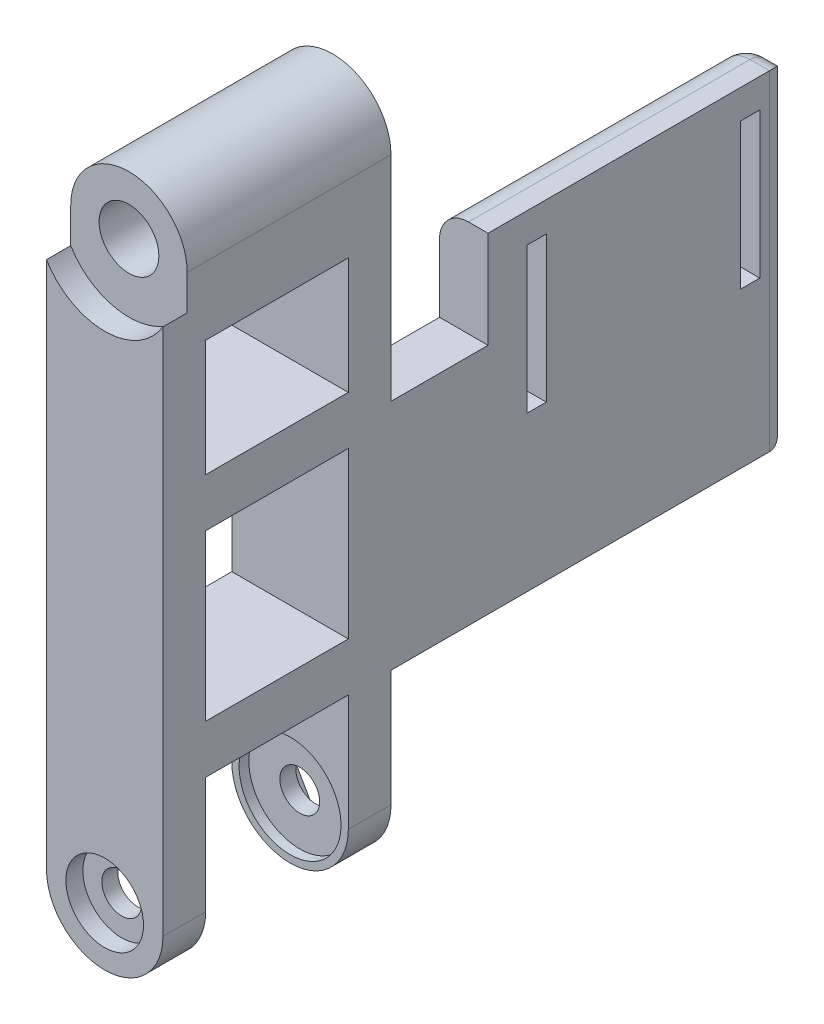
ISO-10303-21;
HEADER;
FILE_DESCRIPTION(('STEP AP214'),'2;1');
FILE_NAME('part.step','',(''),(''),'','','');
FILE_SCHEMA(('AUTOMOTIVE_DESIGN { 1 0 10303 214 1 1 1 1 }'));
ENDSEC;
DATA;
#1=APPLICATION_CONTEXT('core data for automotive mechanical design processes');
#2=APPLICATION_PROTOCOL_DEFINITION('international standard','automotive_design',2000,#1);
#3=PRODUCT_CONTEXT('',#1,'mechanical');
#4=PRODUCT('Part','Part','',(#3));
#5=PRODUCT_RELATED_PRODUCT_CATEGORY('part','',(#4));
#6=PRODUCT_DEFINITION_FORMATION('','',#4);
#7=PRODUCT_DEFINITION_CONTEXT('part definition',#1,'design');
#8=PRODUCT_DEFINITION('design','',#6,#7);
#9=PRODUCT_DEFINITION_SHAPE('','',#8);
#10=(LENGTH_UNIT() NAMED_UNIT(*) SI_UNIT(.MILLI.,.METRE.));
#11=(NAMED_UNIT(*) PLANE_ANGLE_UNIT() SI_UNIT($,.RADIAN.));
#12=(NAMED_UNIT(*) SI_UNIT($,.STERADIAN.) SOLID_ANGLE_UNIT());
#13=UNCERTAINTY_MEASURE_WITH_UNIT(LENGTH_MEASURE(1.E-05),#10,'distance_accuracy_value','');
#14=(GEOMETRIC_REPRESENTATION_CONTEXT(3) GLOBAL_UNCERTAINTY_ASSIGNED_CONTEXT((#13)) GLOBAL_UNIT_ASSIGNED_CONTEXT((#10,
#11,#12)) REPRESENTATION_CONTEXT('',''));
#15=CARTESIAN_POINT('',(0.,0.,0.));
#16=DIRECTION('',(0.,0.,1.));
#17=DIRECTION('',(1.,0.,0.));
#18=AXIS2_PLACEMENT_3D('',#15,#16,#17);
#19=CARTESIAN_POINT('',(12.,36.,-65.5));
#20=DIRECTION('',(0.,-1.,0.));
#21=DIRECTION('',(0.,0.,-1.));
#22=AXIS2_PLACEMENT_3D('',#19,#20,#21);
#23=PLANE('',#22);
#24=DIRECTION('',(1.,0.,0.));
#25=VECTOR('',#24,1.);
#26=CARTESIAN_POINT('',(7.,36.,-34.5));
#27=LINE('',#26,#25);
#28=CARTESIAN_POINT('',(7.,36.,-34.5));
#29=VERTEX_POINT('',#28);
#30=CARTESIAN_POINT('',(12.,36.,-34.5));
#31=VERTEX_POINT('',#30);
#32=EDGE_CURVE('E381',#29,#31,#27,.T.);
#33=ORIENTED_EDGE('',*,*,#32,.F.);
#34=DIRECTION('',(0.,0.,1.));
#35=VECTOR('',#34,1.);
#36=CARTESIAN_POINT('',(7.,36.,-65.5));
#37=LINE('',#36,#35);
#38=CARTESIAN_POINT('',(7.,36.,-24.5));
#39=VERTEX_POINT('',#38);
#40=EDGE_CURVE('E482',#29,#39,#37,.T.);
#41=ORIENTED_EDGE('',*,*,#40,.T.);
#42=DIRECTION('',(-1.,0.,0.));
#43=VECTOR('',#42,1.);
#44=CARTESIAN_POINT('',(12.,36.,-24.5));
#45=LINE('',#44,#43);
#46=CARTESIAN_POINT('',(12.,36.,-24.5));
#47=VERTEX_POINT('',#46);
#48=EDGE_CURVE('E432',#47,#39,#45,.T.);
#49=ORIENTED_EDGE('',*,*,#48,.F.);
#50=DIRECTION('',(0.,0.,1.));
#51=VECTOR('',#50,1.);
#52=CARTESIAN_POINT('',(12.,36.,-65.5));
#53=LINE('',#52,#51);
#54=EDGE_CURVE('E480',#31,#47,#53,.T.);
#55=ORIENTED_EDGE('',*,*,#54,.F.);
#56=EDGE_LOOP('',(#33,#41,#49,#55));
#57=FACE_BOUND('',#56,.T.);
#58=ADVANCED_FACE('F41',(#57),#23,.F.);
#59=CARTESIAN_POINT('',(6.,0.,-25.5));
#60=DIRECTION('',(0.,0.,1.));
#61=DIRECTION('',(1.,0.,0.));
#62=AXIS2_PLACEMENT_3D('',#59,#60,#61);
#63=CYLINDRICAL_SURFACE('',#62,2.05);
#64=CARTESIAN_POINT('',(6.,0.,-22.75));
#65=DIRECTION('',(0.,0.,-1.));
#66=DIRECTION('',(-1.,0.,0.));
#67=AXIS2_PLACEMENT_3D('',#64,#65,#66);
#68=CIRCLE('',#67,2.05);
#69=CARTESIAN_POINT('',(3.95,0.,-22.75));
#70=VERTEX_POINT('',#69);
#71=EDGE_CURVE('E486',#70,#70,#68,.F.);
#72=ORIENTED_EDGE('',*,*,#71,.F.);
#73=EDGE_LOOP('',(#72));
#74=FACE_BOUND('',#73,.T.);
#75=CARTESIAN_POINT('',(6.,0.,-21.1));
#76=DIRECTION('',(0.,0.,1.));
#77=DIRECTION('',(1.,0.,0.));
#78=AXIS2_PLACEMENT_3D('',#75,#76,#77);
#79=CIRCLE('',#78,2.05);
#80=CARTESIAN_POINT('',(8.05,0.,-21.1));
#81=VERTEX_POINT('',#80);
#82=EDGE_CURVE('E422',#81,#81,#79,.F.);
#83=ORIENTED_EDGE('',*,*,#82,.F.);
#84=EDGE_LOOP('',(#83));
#85=FACE_BOUND('',#84,.T.);
#86=ADVANCED_FACE('F737',(#74,#85),#63,.F.);
#87=CARTESIAN_POINT('',(6.,0.,-2.75));
#88=DIRECTION('',(0.,0.,1.));
#89=DIRECTION('',(1.,0.,0.));
#90=AXIS2_PLACEMENT_3D('',#87,#88,#89);
#91=CIRCLE('',#90,2.05);
#92=CARTESIAN_POINT('',(8.05,0.,-2.75));
#93=VERTEX_POINT('',#92);
#94=EDGE_CURVE('E524',#93,#93,#91,.F.);
#95=ORIENTED_EDGE('',*,*,#94,.F.);
#96=EDGE_LOOP('',(#95));
#97=FACE_BOUND('',#96,.T.);
#98=CARTESIAN_POINT('',(6.,0.,-4.4));
#99=DIRECTION('',(0.,0.,-1.));
#100=DIRECTION('',(-1.,0.,0.));
#101=AXIS2_PLACEMENT_3D('',#98,#99,#100);
#102=CIRCLE('',#101,2.05);
#103=CARTESIAN_POINT('',(3.95,0.,-4.4));
#104=VERTEX_POINT('',#103);
#105=EDGE_CURVE('E428',#104,#104,#102,.F.);
#106=ORIENTED_EDGE('',*,*,#105,.F.);
#107=EDGE_LOOP('',(#106));
#108=FACE_BOUND('',#107,.T.);
#109=ADVANCED_FACE('F744',(#97,#108),#63,.F.);
#110=CARTESIAN_POINT('',(0.,0.,-25.5));
#111=DIRECTION('',(-1.,0.,0.));
#112=DIRECTION('',(0.,-1.,0.));
#113=AXIS2_PLACEMENT_3D('',#110,#111,#112);
#114=PLANE('',#113);
#115=DIRECTION('',(0.,1.,0.));
#116=VECTOR('',#115,1.);
#117=CARTESIAN_POINT('',(0.,0.,-5.4));
#118=LINE('',#117,#116);
#119=CARTESIAN_POINT('',(0.,17.,-5.4));
#120=VERTEX_POINT('',#119);
#121=CARTESIAN_POINT('',(0.,34.,-5.4));
#122=VERTEX_POINT('',#121);
#123=EDGE_CURVE('E566',#120,#122,#118,.T.);
#124=ORIENTED_EDGE('',*,*,#123,.F.);
#125=DIRECTION('',(0.,0.,1.));
#126=VECTOR('',#125,1.);
#127=CARTESIAN_POINT('',(0.,17.,-25.5));
#128=LINE('',#127,#126);
#129=CARTESIAN_POINT('',(0.,17.,-20.1));
#130=VERTEX_POINT('',#129);
#131=EDGE_CURVE('E559',#130,#120,#128,.T.);
#132=ORIENTED_EDGE('',*,*,#131,.F.);
#133=DIRECTION('',(0.,-1.,0.));
#134=VECTOR('',#133,1.);
#135=CARTESIAN_POINT('',(0.,0.,-20.1));
#136=LINE('',#135,#134);
#137=CARTESIAN_POINT('',(0.,34.,-20.1));
#138=VERTEX_POINT('',#137);
#139=EDGE_CURVE('E561',#138,#130,#136,.T.);
#140=ORIENTED_EDGE('',*,*,#139,.F.);
#141=DIRECTION('',(0.,0.,-1.));
#142=VECTOR('',#141,1.);
#143=CARTESIAN_POINT('',(0.,34.,-25.5));
#144=LINE('',#143,#142);
#145=EDGE_CURVE('E564',#122,#138,#144,.T.);
#146=ORIENTED_EDGE('',*,*,#145,.F.);
#147=EDGE_LOOP('',(#124,#132,#140,#146));
#148=FACE_BOUND('',#147,.T.);
#149=DIRECTION('',(0.,1.,0.));
#150=VECTOR('',#149,1.);
#151=CARTESIAN_POINT('',(0.,0.,-5.4));
#152=LINE('',#151,#150);
#153=CARTESIAN_POINT('',(0.,39.,-5.4));
#154=VERTEX_POINT('',#153);
#155=CARTESIAN_POINT('',(0.,51.,-5.4));
#156=VERTEX_POINT('',#155);
#157=EDGE_CURVE('E557',#154,#156,#152,.T.);
#158=ORIENTED_EDGE('',*,*,#157,.F.);
#159=DIRECTION('',(0.,0.,1.));
#160=VECTOR('',#159,1.);
#161=CARTESIAN_POINT('',(0.,39.,-25.5));
#162=LINE('',#161,#160);
#163=CARTESIAN_POINT('',(0.,39.,-20.1));
#164=VERTEX_POINT('',#163);
#165=EDGE_CURVE('E550',#164,#154,#162,.T.);
#166=ORIENTED_EDGE('',*,*,#165,.F.);
#167=DIRECTION('',(0.,-1.,0.));
#168=VECTOR('',#167,1.);
#169=CARTESIAN_POINT('',(0.,0.,-20.1));
#170=LINE('',#169,#168);
#171=CARTESIAN_POINT('',(0.,51.,-20.1));
#172=VERTEX_POINT('',#171);
#173=EDGE_CURVE('E552',#172,#164,#170,.T.);
#174=ORIENTED_EDGE('',*,*,#173,.F.);
#175=DIRECTION('',(0.,0.,-1.));
#176=VECTOR('',#175,1.);
#177=CARTESIAN_POINT('',(0.,51.,-25.5));
#178=LINE('',#177,#176);
#179=EDGE_CURVE('E555',#156,#172,#178,.T.);
#180=ORIENTED_EDGE('',*,*,#179,.F.);
#181=EDGE_LOOP('',(#158,#166,#174,#180));
#182=FACE_BOUND('',#181,.T.);
#183=DIRECTION('',(0.,-1.,0.));
#184=VECTOR('',#183,1.);
#185=CARTESIAN_POINT('',(0.,0.,-24.5));
#186=LINE('',#185,#184);
#187=CARTESIAN_POINT('',(0.,58.,-24.5));
#188=VERTEX_POINT('',#187);
#189=CARTESIAN_POINT('',(0.,0.,-24.5));
#190=VERTEX_POINT('',#189);
#191=EDGE_CURVE('E457',#188,#190,#186,.T.);
#192=ORIENTED_EDGE('',*,*,#191,.T.);
#193=DIRECTION('',(0.,0.,1.));
#194=VECTOR('',#193,1.);
#195=CARTESIAN_POINT('',(0.,0.,-25.5));
#196=LINE('',#195,#194);
#197=CARTESIAN_POINT('',(0.,0.,-20.1));
#198=VERTEX_POINT('',#197);
#199=EDGE_CURVE('E571',#190,#198,#196,.T.);
#200=ORIENTED_EDGE('',*,*,#199,.T.);
#201=DIRECTION('',(0.,-1.,0.));
#202=VECTOR('',#201,1.);
#203=CARTESIAN_POINT('',(0.,0.,-20.1));
#204=LINE('',#203,#202);
#205=CARTESIAN_POINT('',(0.,12.,-20.1));
#206=VERTEX_POINT('',#205);
#207=EDGE_CURVE('E499',#206,#198,#204,.T.);
#208=ORIENTED_EDGE('',*,*,#207,.F.);
#209=DIRECTION('',(0.,0.,-1.));
#210=VECTOR('',#209,1.);
#211=CARTESIAN_POINT('',(0.,12.,-25.5));
#212=LINE('',#211,#210);
#213=CARTESIAN_POINT('',(0.,12.,-5.4));
#214=VERTEX_POINT('',#213);
#215=EDGE_CURVE('E568',#214,#206,#212,.T.);
#216=ORIENTED_EDGE('',*,*,#215,.F.);
#217=DIRECTION('',(0.,1.,0.));
#218=VECTOR('',#217,1.);
#219=CARTESIAN_POINT('',(0.,0.,-5.4));
#220=LINE('',#219,#218);
#221=CARTESIAN_POINT('',(0.,0.,-5.4));
#222=VERTEX_POINT('',#221);
#223=EDGE_CURVE('E546',#222,#214,#220,.T.);
#224=ORIENTED_EDGE('',*,*,#223,.F.);
#225=CARTESIAN_POINT('',(0.,0.,-1.));
#226=VERTEX_POINT('',#225);
#227=EDGE_CURVE('E574',#222,#226,#196,.T.);
#228=ORIENTED_EDGE('',*,*,#227,.T.);
#229=DIRECTION('',(0.,-1.,0.));
#230=VECTOR('',#229,1.);
#231=CARTESIAN_POINT('',(0.,0.,-1.));
#232=LINE('',#231,#230);
#233=CARTESIAN_POINT('',(0.,54.394448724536,-1.));
#234=VERTEX_POINT('',#233);
#235=EDGE_CURVE('E452',#234,#226,#232,.T.);
#236=ORIENTED_EDGE('',*,*,#235,.F.);
#237=DIRECTION('',(0.,0.,1.));
#238=VECTOR('',#237,1.);
#239=CARTESIAN_POINT('',(0.,54.394448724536,-3.5));
#240=LINE('',#239,#238);
#241=CARTESIAN_POINT('',(0.,54.394448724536,-3.5));
#242=VERTEX_POINT('',#241);
#243=EDGE_CURVE('E477',#242,#234,#240,.T.);
#244=ORIENTED_EDGE('',*,*,#243,.F.);
#245=DIRECTION('',(0.,1.,0.));
#246=VECTOR('',#245,1.);
#247=CARTESIAN_POINT('',(0.,0.,-3.5));
#248=LINE('',#247,#246);
#249=CARTESIAN_POINT('',(0.,58.,-3.5));
#250=VERTEX_POINT('',#249);
#251=EDGE_CURVE('E472',#242,#250,#248,.T.);
#252=ORIENTED_EDGE('',*,*,#251,.T.);
#253=DIRECTION('',(0.,0.,1.));
#254=VECTOR('',#253,1.);
#255=CARTESIAN_POINT('',(0.,58.,-25.5));
#256=LINE('',#255,#254);
#257=EDGE_CURVE('E575',#188,#250,#256,.T.);
#258=ORIENTED_EDGE('',*,*,#257,.F.);
#259=EDGE_LOOP('',(#192,#200,#208,#216,#224,#228,#236,#244,#252,#258));
#260=FACE_BOUND('',#259,.T.);
#261=ADVANCED_FACE('F815',(#148,#182,#260),#114,.T.);
#262=CARTESIAN_POINT('',(6.,0.,-25.5));
#263=DIRECTION('',(0.,0.,1.));
#264=DIRECTION('',(1.,0.,0.));
#265=AXIS2_PLACEMENT_3D('',#262,#263,#264);
#266=CYLINDRICAL_SURFACE('',#265,6.);
#267=ORIENTED_EDGE('',*,*,#199,.F.);
#268=CARTESIAN_POINT('',(6.,0.,-24.5));
#269=DIRECTION('',(0.,0.,-1.));
#270=DIRECTION('',(-1.,0.,0.));
#271=AXIS2_PLACEMENT_3D('',#268,#269,#270);
#272=CIRCLE('',#271,6.);
#273=CARTESIAN_POINT('',(12.,0.,-24.5));
#274=VERTEX_POINT('',#273);
#275=EDGE_CURVE('E443',#274,#190,#272,.T.);
#276=ORIENTED_EDGE('',*,*,#275,.F.);
#277=DIRECTION('',(0.,0.,1.));
#278=VECTOR('',#277,1.);
#279=CARTESIAN_POINT('',(12.,0.,-25.5));
#280=LINE('',#279,#278);
#281=CARTESIAN_POINT('',(12.,0.,-20.1));
#282=VERTEX_POINT('',#281);
#283=EDGE_CURVE('E579',#274,#282,#280,.T.);
#284=ORIENTED_EDGE('',*,*,#283,.T.);
#285=CARTESIAN_POINT('',(6.,0.,-20.1));
#286=DIRECTION('',(0.,0.,-1.));
#287=DIRECTION('',(-1.,0.,0.));
#288=AXIS2_PLACEMENT_3D('',#285,#286,#287);
#289=CIRCLE('',#288,6.);
#290=EDGE_CURVE('E543',#198,#282,#289,.F.);
#291=ORIENTED_EDGE('',*,*,#290,.F.);
#292=EDGE_LOOP('',(#267,#276,#284,#291));
#293=FACE_BOUND('',#292,.T.);
#294=ADVANCED_FACE('F818',(#293),#266,.T.);
#295=CARTESIAN_POINT('',(12.,0.,-5.4));
#296=VERTEX_POINT('',#295);
#297=CARTESIAN_POINT('',(12.,0.,-1.));
#298=VERTEX_POINT('',#297);
#299=EDGE_CURVE('E570',#296,#298,#280,.T.);
#300=ORIENTED_EDGE('',*,*,#299,.T.);
#301=CARTESIAN_POINT('',(6.,0.,-1.));
#302=DIRECTION('',(0.,0.,1.));
#303=DIRECTION('',(1.,0.,0.));
#304=AXIS2_PLACEMENT_3D('',#301,#302,#303);
#305=CIRCLE('',#304,6.);
#306=EDGE_CURVE('E446',#226,#298,#305,.T.);
#307=ORIENTED_EDGE('',*,*,#306,.F.);
#308=ORIENTED_EDGE('',*,*,#227,.F.);
#309=CARTESIAN_POINT('',(6.,0.,-5.4));
#310=DIRECTION('',(0.,0.,1.));
#311=DIRECTION('',(1.,0.,0.));
#312=AXIS2_PLACEMENT_3D('',#309,#310,#311);
#313=CIRCLE('',#312,6.);
#314=EDGE_CURVE('E548',#296,#222,#313,.F.);
#315=ORIENTED_EDGE('',*,*,#314,.F.);
#316=EDGE_LOOP('',(#300,#307,#308,#315));
#317=FACE_BOUND('',#316,.T.);
#318=ADVANCED_FACE('F825',(#317),#266,.T.);
#319=CARTESIAN_POINT('',(12.,0.,-25.5));
#320=DIRECTION('',(1.,0.,0.));
#321=DIRECTION('',(0.,1.,0.));
#322=AXIS2_PLACEMENT_3D('',#319,#320,#321);
#323=PLANE('',#322);
#324=DIRECTION('',(0.,-1.,0.));
#325=VECTOR('',#324,1.);
#326=CARTESIAN_POINT('',(12.,42.9325037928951,-38.5));
#327=LINE('',#326,#325);
#328=CARTESIAN_POINT('',(12.,42.9325037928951,-38.5));
#329=VERTEX_POINT('',#328);
#330=CARTESIAN_POINT('',(12.,27.9325037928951,-38.5));
#331=VERTEX_POINT('',#330);
#332=EDGE_CURVE('E366',#329,#331,#327,.T.);
#333=ORIENTED_EDGE('',*,*,#332,.F.);
#334=DIRECTION('',(0.,0.,1.));
#335=VECTOR('',#334,1.);
#336=CARTESIAN_POINT('',(12.,42.9325037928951,-38.5));
#337=LINE('',#336,#335);
#338=CARTESIAN_POINT('',(12.,42.9325037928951,-40.5));
#339=VERTEX_POINT('',#338);
#340=EDGE_CURVE('E375',#339,#329,#337,.T.);
#341=ORIENTED_EDGE('',*,*,#340,.F.);
#342=DIRECTION('',(0.,1.,0.));
#343=VECTOR('',#342,1.);
#344=CARTESIAN_POINT('',(12.,42.9325037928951,-40.5));
#345=LINE('',#344,#343);
#346=CARTESIAN_POINT('',(12.,27.9325037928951,-40.5));
#347=VERTEX_POINT('',#346);
#348=EDGE_CURVE('E372',#347,#339,#345,.T.);
#349=ORIENTED_EDGE('',*,*,#348,.F.);
#350=DIRECTION('',(0.,0.,-1.));
#351=VECTOR('',#350,1.);
#352=CARTESIAN_POINT('',(12.,27.9325037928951,-38.5));
#353=LINE('',#352,#351);
#354=EDGE_CURVE('E368',#331,#347,#353,.T.);
#355=ORIENTED_EDGE('',*,*,#354,.F.);
#356=EDGE_LOOP('',(#333,#341,#349,#355));
#357=FACE_BOUND('',#356,.T.);
#358=DIRECTION('',(0.,-1.,0.));
#359=VECTOR('',#358,1.);
#360=CARTESIAN_POINT('',(12.,43.,-60.5));
#361=LINE('',#360,#359);
#362=CARTESIAN_POINT('',(12.,43.,-60.5));
#363=VERTEX_POINT('',#362);
#364=CARTESIAN_POINT('',(12.,28.,-60.5));
#365=VERTEX_POINT('',#364);
#366=EDGE_CURVE('E369',#363,#365,#361,.T.);
#367=ORIENTED_EDGE('',*,*,#366,.F.);
#368=DIRECTION('',(0.,0.,1.));
#369=VECTOR('',#368,1.);
#370=CARTESIAN_POINT('',(12.,43.,-60.5));
#371=LINE('',#370,#369);
#372=CARTESIAN_POINT('',(12.,43.,-62.5));
#373=VERTEX_POINT('',#372);
#374=EDGE_CURVE('E391',#373,#363,#371,.T.);
#375=ORIENTED_EDGE('',*,*,#374,.F.);
#376=DIRECTION('',(0.,1.,0.));
#377=VECTOR('',#376,1.);
#378=CARTESIAN_POINT('',(12.,43.,-62.5));
#379=LINE('',#378,#377);
#380=CARTESIAN_POINT('',(12.,28.,-62.5));
#381=VERTEX_POINT('',#380);
#382=EDGE_CURVE('E400',#381,#373,#379,.T.);
#383=ORIENTED_EDGE('',*,*,#382,.F.);
#384=DIRECTION('',(0.,0.,-1.));
#385=VECTOR('',#384,1.);
#386=CARTESIAN_POINT('',(12.,28.,-60.5));
#387=LINE('',#386,#385);
#388=EDGE_CURVE('E403',#365,#381,#387,.T.);
#389=ORIENTED_EDGE('',*,*,#388,.F.);
#390=EDGE_LOOP('',(#367,#375,#383,#389));
#391=FACE_BOUND('',#390,.T.);
#392=DIRECTION('',(0.,0.,1.));
#393=VECTOR('',#392,1.);
#394=CARTESIAN_POINT('',(12.,12.,-65.5));
#395=LINE('',#394,#393);
#396=CARTESIAN_POINT('',(12.,12.,-63.5));
#397=VERTEX_POINT('',#396);
#398=CARTESIAN_POINT('',(12.,12.,-24.5));
#399=VERTEX_POINT('',#398);
#400=EDGE_CURVE('E484',#397,#399,#395,.T.);
#401=ORIENTED_EDGE('',*,*,#400,.F.);
#402=DIRECTION('',(0.,-1.,0.));
#403=VECTOR('',#402,1.);
#404=CARTESIAN_POINT('',(12.,0.,-63.5));
#405=LINE('',#404,#403);
#406=CARTESIAN_POINT('',(12.,46.,-63.5));
#407=VERTEX_POINT('',#406);
#408=EDGE_CURVE('E50',#397,#407,#405,.F.);
#409=ORIENTED_EDGE('',*,*,#408,.T.);
#410=DIRECTION('',(0.,0.,-1.));
#411=VECTOR('',#410,1.);
#412=CARTESIAN_POINT('',(12.,46.,-65.5));
#413=LINE('',#412,#411);
#414=CARTESIAN_POINT('',(12.,46.,-34.5));
#415=VERTEX_POINT('',#414);
#416=EDGE_CURVE('E409',#415,#407,#413,.T.);
#417=ORIENTED_EDGE('',*,*,#416,.F.);
#418=DIRECTION('',(0.,-1.,0.));
#419=VECTOR('',#418,1.);
#420=CARTESIAN_POINT('',(12.,46.,-34.5));
#421=LINE('',#420,#419);
#422=EDGE_CURVE('E412',#415,#31,#421,.T.);
#423=ORIENTED_EDGE('',*,*,#422,.T.);
#424=ORIENTED_EDGE('',*,*,#54,.T.);
#425=DIRECTION('',(0.,1.,0.));
#426=VECTOR('',#425,1.);
#427=CARTESIAN_POINT('',(12.,0.,-24.5));
#428=LINE('',#427,#426);
#429=CARTESIAN_POINT('',(12.,58.,-24.5));
#430=VERTEX_POINT('',#429);
#431=EDGE_CURVE('E573',#47,#430,#428,.T.);
#432=ORIENTED_EDGE('',*,*,#431,.T.);
#433=DIRECTION('',(0.,0.,1.));
#434=VECTOR('',#433,1.);
#435=CARTESIAN_POINT('',(12.,58.,-25.5));
#436=LINE('',#435,#434);
#437=CARTESIAN_POINT('',(12.,58.,-3.5));
#438=VERTEX_POINT('',#437);
#439=EDGE_CURVE('E577',#430,#438,#436,.T.);
#440=ORIENTED_EDGE('',*,*,#439,.T.);
#441=DIRECTION('',(0.,-1.,0.));
#442=VECTOR('',#441,1.);
#443=CARTESIAN_POINT('',(12.,0.,-3.5));
#444=LINE('',#443,#442);
#445=CARTESIAN_POINT('',(12.,54.394448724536,-3.5));
#446=VERTEX_POINT('',#445);
#447=EDGE_CURVE('E466',#438,#446,#444,.T.);
#448=ORIENTED_EDGE('',*,*,#447,.T.);
#449=DIRECTION('',(0.,0.,1.));
#450=VECTOR('',#449,1.);
#451=CARTESIAN_POINT('',(12.,54.394448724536,-3.5));
#452=LINE('',#451,#450);
#453=CARTESIAN_POINT('',(12.,54.394448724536,-1.));
#454=VERTEX_POINT('',#453);
#455=EDGE_CURVE('E475',#454,#446,#452,.F.);
#456=ORIENTED_EDGE('',*,*,#455,.F.);
#457=DIRECTION('',(0.,1.,0.));
#458=VECTOR('',#457,1.);
#459=CARTESIAN_POINT('',(12.,54.394448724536,-1.));
#460=LINE('',#459,#458);
#461=EDGE_CURVE('E448',#298,#454,#460,.T.);
#462=ORIENTED_EDGE('',*,*,#461,.F.);
#463=ORIENTED_EDGE('',*,*,#299,.F.);
#464=DIRECTION('',(0.,-1.,0.));
#465=VECTOR('',#464,1.);
#466=CARTESIAN_POINT('',(12.,-6.,-5.4));
#467=LINE('',#466,#465);
#468=CARTESIAN_POINT('',(12.,12.,-5.4));
#469=VERTEX_POINT('',#468);
#470=EDGE_CURVE('E487',#469,#296,#467,.T.);
#471=ORIENTED_EDGE('',*,*,#470,.F.);
#472=DIRECTION('',(0.,0.,1.));
#473=VECTOR('',#472,1.);
#474=CARTESIAN_POINT('',(12.,12.,-5.4));
#475=LINE('',#474,#473);
#476=CARTESIAN_POINT('',(12.,12.,-20.1));
#477=VERTEX_POINT('',#476);
#478=EDGE_CURVE('E493',#477,#469,#475,.T.);
#479=ORIENTED_EDGE('',*,*,#478,.F.);
#480=DIRECTION('',(0.,1.,0.));
#481=VECTOR('',#480,1.);
#482=CARTESIAN_POINT('',(12.,-6.,-20.1));
#483=LINE('',#482,#481);
#484=EDGE_CURVE('E489',#282,#477,#483,.T.);
#485=ORIENTED_EDGE('',*,*,#484,.F.);
#486=ORIENTED_EDGE('',*,*,#283,.F.);
#487=DIRECTION('',(0.,-1.,0.));
#488=VECTOR('',#487,1.);
#489=CARTESIAN_POINT('',(12.,12.,-24.5));
#490=LINE('',#489,#488);
#491=EDGE_CURVE('E441',#399,#274,#490,.T.);
#492=ORIENTED_EDGE('',*,*,#491,.F.);
#493=EDGE_LOOP('',(#401,#409,#417,#423,#424,#432,#440,#448,#456,#462,#463,#471,#479,#485,#486,#492));
#494=FACE_BOUND('',#493,.T.);
#495=DIRECTION('',(0.,-1.,0.));
#496=VECTOR('',#495,1.);
#497=CARTESIAN_POINT('',(12.,17.,-5.4));
#498=LINE('',#497,#496);
#499=CARTESIAN_POINT('',(12.,34.,-5.4));
#500=VERTEX_POINT('',#499);
#501=CARTESIAN_POINT('',(12.,17.,-5.4));
#502=VERTEX_POINT('',#501);
#503=EDGE_CURVE('E501',#500,#502,#498,.T.);
#504=ORIENTED_EDGE('',*,*,#503,.F.);
#505=DIRECTION('',(0.,0.,1.));
#506=VECTOR('',#505,1.);
#507=CARTESIAN_POINT('',(12.,34.,-5.4));
#508=LINE('',#507,#506);
#509=CARTESIAN_POINT('',(12.,34.,-20.1));
#510=VERTEX_POINT('',#509);
#511=EDGE_CURVE('E510',#510,#500,#508,.T.);
#512=ORIENTED_EDGE('',*,*,#511,.F.);
#513=DIRECTION('',(0.,1.,0.));
#514=VECTOR('',#513,1.);
#515=CARTESIAN_POINT('',(12.,17.,-20.1));
#516=LINE('',#515,#514);
#517=CARTESIAN_POINT('',(12.,17.,-20.1));
#518=VERTEX_POINT('',#517);
#519=EDGE_CURVE('E507',#518,#510,#516,.T.);
#520=ORIENTED_EDGE('',*,*,#519,.F.);
#521=DIRECTION('',(0.,0.,-1.));
#522=VECTOR('',#521,1.);
#523=CARTESIAN_POINT('',(12.,17.,-5.4));
#524=LINE('',#523,#522);
#525=EDGE_CURVE('E503',#502,#518,#524,.T.);
#526=ORIENTED_EDGE('',*,*,#525,.F.);
#527=EDGE_LOOP('',(#504,#512,#520,#526));
#528=FACE_BOUND('',#527,.T.);
#529=DIRECTION('',(0.,-1.,0.));
#530=VECTOR('',#529,1.);
#531=CARTESIAN_POINT('',(12.,39.,-5.4));
#532=LINE('',#531,#530);
#533=CARTESIAN_POINT('',(12.,51.,-5.4));
#534=VERTEX_POINT('',#533);
#535=CARTESIAN_POINT('',(12.,39.,-5.4));
#536=VERTEX_POINT('',#535);
#537=EDGE_CURVE('E521',#534,#536,#532,.T.);
#538=ORIENTED_EDGE('',*,*,#537,.F.);
#539=DIRECTION('',(0.,0.,1.));
#540=VECTOR('',#539,1.);
#541=CARTESIAN_POINT('',(12.,51.,-5.4));
#542=LINE('',#541,#540);
#543=CARTESIAN_POINT('',(12.,51.,-20.1));
#544=VERTEX_POINT('',#543);
#545=EDGE_CURVE('E530',#544,#534,#542,.T.);
#546=ORIENTED_EDGE('',*,*,#545,.F.);
#547=DIRECTION('',(0.,1.,0.));
#548=VECTOR('',#547,1.);
#549=CARTESIAN_POINT('',(12.,39.,-20.1));
#550=LINE('',#549,#548);
#551=CARTESIAN_POINT('',(12.,39.,-20.1));
#552=VERTEX_POINT('',#551);
#553=EDGE_CURVE('E527',#552,#544,#550,.T.);
#554=ORIENTED_EDGE('',*,*,#553,.F.);
#555=DIRECTION('',(0.,0.,-1.));
#556=VECTOR('',#555,1.);
#557=CARTESIAN_POINT('',(12.,39.,-5.4));
#558=LINE('',#557,#556);
#559=EDGE_CURVE('E523',#536,#552,#558,.T.);
#560=ORIENTED_EDGE('',*,*,#559,.F.);
#561=EDGE_LOOP('',(#538,#546,#554,#560));
#562=FACE_BOUND('',#561,.T.);
#563=ADVANCED_FACE('F701',(#357,#391,#494,#528,#562),#323,.T.);
#564=CARTESIAN_POINT('',(5.99999999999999,58.,-3.5));
#565=DIRECTION('',(0.,0.,1.));
#566=DIRECTION('',(1.,0.,0.));
#567=AXIS2_PLACEMENT_3D('',#564,#565,#566);
#568=CYLINDRICAL_SURFACE('',#567,7.);
#569=CARTESIAN_POINT('',(5.99999999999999,58.,-1.));
#570=DIRECTION('',(0.,0.,-1.));
#571=DIRECTION('',(1.,0.,0.));
#572=AXIS2_PLACEMENT_3D('',#569,#570,#571);
#573=CIRCLE('',#572,7.);
#574=EDGE_CURVE('E450',#454,#234,#573,.T.);
#575=ORIENTED_EDGE('',*,*,#574,.F.);
#576=ORIENTED_EDGE('',*,*,#455,.T.);
#577=CARTESIAN_POINT('',(5.99999999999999,58.,-3.5));
#578=DIRECTION('',(0.,0.,1.));
#579=DIRECTION('',(1.,0.,0.));
#580=AXIS2_PLACEMENT_3D('',#577,#578,#579);
#581=CIRCLE('',#580,7.);
#582=EDGE_CURVE('E462',#242,#446,#581,.T.);
#583=ORIENTED_EDGE('',*,*,#582,.F.);
#584=ORIENTED_EDGE('',*,*,#243,.T.);
#585=EDGE_LOOP('',(#575,#576,#583,#584));
#586=FACE_BOUND('',#585,.T.);
#587=ADVANCED_FACE('F822',(#586),#568,.F.);
#588=CARTESIAN_POINT('',(5.99999999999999,58.,-25.5));
#589=DIRECTION('',(0.,0.,1.));
#590=DIRECTION('',(1.,0.,0.));
#591=AXIS2_PLACEMENT_3D('',#588,#589,#590);
#592=CYLINDRICAL_SURFACE('',#591,6.);
#593=ORIENTED_EDGE('',*,*,#439,.F.);
#594=CARTESIAN_POINT('',(5.99999999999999,58.,-24.5));
#595=DIRECTION('',(0.,0.,-1.));
#596=DIRECTION('',(-1.,0.,0.));
#597=AXIS2_PLACEMENT_3D('',#594,#595,#596);
#598=CIRCLE('',#597,6.);
#599=EDGE_CURVE('E454',#430,#188,#598,.F.);
#600=ORIENTED_EDGE('',*,*,#599,.T.);
#601=ORIENTED_EDGE('',*,*,#257,.T.);
#602=CARTESIAN_POINT('',(5.99999999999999,58.,-3.5));
#603=DIRECTION('',(0.,0.,1.));
#604=DIRECTION('',(1.,0.,0.));
#605=AXIS2_PLACEMENT_3D('',#602,#603,#604);
#606=CIRCLE('',#605,6.);
#607=EDGE_CURVE('E469',#250,#438,#606,.F.);
#608=ORIENTED_EDGE('',*,*,#607,.T.);
#609=EDGE_LOOP('',(#593,#600,#601,#608));
#610=FACE_BOUND('',#609,.T.);
#611=ADVANCED_FACE('F813',(#610),#592,.T.);
#612=CARTESIAN_POINT('',(5.99999999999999,58.,-25.5));
#613=DIRECTION('',(0.,0.,1.));
#614=DIRECTION('',(1.,0.,0.));
#615=AXIS2_PLACEMENT_3D('',#612,#613,#614);
#616=CYLINDRICAL_SURFACE('',#615,3.08);
#617=CARTESIAN_POINT('',(5.99999999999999,58.,-3.5));
#618=DIRECTION('',(0.,0.,1.));
#619=DIRECTION('',(1.,0.,0.));
#620=AXIS2_PLACEMENT_3D('',#617,#618,#619);
#621=CIRCLE('',#620,3.08);
#622=CARTESIAN_POINT('',(9.07999999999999,58.,-3.5));
#623=VERTEX_POINT('',#622);
#624=EDGE_CURVE('E465',#623,#623,#621,.F.);
#625=ORIENTED_EDGE('',*,*,#624,.F.);
#626=EDGE_LOOP('',(#625));
#627=FACE_BOUND('',#626,.T.);
#628=CARTESIAN_POINT('',(5.99999999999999,58.,-24.5));
#629=DIRECTION('',(0.,0.,-1.));
#630=DIRECTION('',(-1.,0.,0.));
#631=AXIS2_PLACEMENT_3D('',#628,#629,#630);
#632=CIRCLE('',#631,3.08);
#633=CARTESIAN_POINT('',(2.91999999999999,58.,-24.5));
#634=VERTEX_POINT('',#633);
#635=EDGE_CURVE('E459',#634,#634,#632,.F.);
#636=ORIENTED_EDGE('',*,*,#635,.F.);
#637=EDGE_LOOP('',(#636));
#638=FACE_BOUND('',#637,.T.);
#639=ADVANCED_FACE('F779',(#627,#638),#616,.F.);
#640=CARTESIAN_POINT('',(-8.,-6.,-5.4));
#641=DIRECTION('',(0.,0.,1.));
#642=DIRECTION('',(1.,0.,0.));
#643=AXIS2_PLACEMENT_3D('',#640,#641,#642);
#644=PLANE('',#643);
#645=CARTESIAN_POINT('',(6.,0.,-5.4));
#646=DIRECTION('',(0.,0.,-1.));
#647=DIRECTION('',(-1.,0.,0.));
#648=AXIS2_PLACEMENT_3D('',#645,#646,#647);
#649=CIRCLE('',#648,5.25);
#650=CARTESIAN_POINT('',(0.75,0.,-5.4));
#651=VERTEX_POINT('',#650);
#652=EDGE_CURVE('E429',#651,#651,#649,.T.);
#653=ORIENTED_EDGE('',*,*,#652,.F.);
#654=EDGE_LOOP('',(#653));
#655=FACE_BOUND('',#654,.T.);
#656=ORIENTED_EDGE('',*,*,#314,.T.);
#657=ORIENTED_EDGE('',*,*,#223,.T.);
#658=DIRECTION('',(1.,0.,0.));
#659=VECTOR('',#658,1.);
#660=CARTESIAN_POINT('',(-8.,12.,-5.4));
#661=LINE('',#660,#659);
#662=EDGE_CURVE('E497',#214,#469,#661,.T.);
#663=ORIENTED_EDGE('',*,*,#662,.T.);
#664=ORIENTED_EDGE('',*,*,#470,.T.);
#665=EDGE_LOOP('',(#656,#657,#663,#664));
#666=FACE_BOUND('',#665,.T.);
#667=ADVANCED_FACE('F775',(#655,#666),#644,.F.);
#668=CARTESIAN_POINT('',(-8.,-6.,-20.1));
#669=DIRECTION('',(0.,0.,-1.));
#670=DIRECTION('',(-1.,0.,0.));
#671=AXIS2_PLACEMENT_3D('',#668,#669,#670);
#672=PLANE('',#671);
#673=CARTESIAN_POINT('',(6.,0.,-20.1));
#674=DIRECTION('',(0.,0.,1.));
#675=DIRECTION('',(1.,0.,0.));
#676=AXIS2_PLACEMENT_3D('',#673,#674,#675);
#677=CIRCLE('',#676,5.25);
#678=CARTESIAN_POINT('',(11.25,0.,-20.1));
#679=VERTEX_POINT('',#678);
#680=EDGE_CURVE('E418',#679,#679,#677,.T.);
#681=ORIENTED_EDGE('',*,*,#680,.F.);
#682=EDGE_LOOP('',(#681));
#683=FACE_BOUND('',#682,.T.);
#684=ORIENTED_EDGE('',*,*,#290,.T.);
#685=ORIENTED_EDGE('',*,*,#484,.T.);
#686=DIRECTION('',(1.,0.,0.));
#687=VECTOR('',#686,1.);
#688=CARTESIAN_POINT('',(-8.,12.,-20.1));
#689=LINE('',#688,#687);
#690=EDGE_CURVE('E496',#206,#477,#689,.T.);
#691=ORIENTED_EDGE('',*,*,#690,.F.);
#692=ORIENTED_EDGE('',*,*,#207,.T.);
#693=EDGE_LOOP('',(#684,#685,#691,#692));
#694=FACE_BOUND('',#693,.T.);
#695=ADVANCED_FACE('F771',(#683,#694),#672,.F.);
#696=CARTESIAN_POINT('',(-8.,12.,-5.4));
#697=DIRECTION('',(0.,1.,0.));
#698=DIRECTION('',(-1.,0.,0.));
#699=AXIS2_PLACEMENT_3D('',#696,#697,#698);
#700=PLANE('',#699);
#701=ORIENTED_EDGE('',*,*,#215,.T.);
#702=ORIENTED_EDGE('',*,*,#690,.T.);
#703=ORIENTED_EDGE('',*,*,#478,.T.);
#704=ORIENTED_EDGE('',*,*,#662,.F.);
#705=EDGE_LOOP('',(#701,#702,#703,#704));
#706=FACE_BOUND('',#705,.T.);
#707=ADVANCED_FACE('F767',(#706),#700,.F.);
#708=CARTESIAN_POINT('',(-8.00000000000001,39.,-5.4));
#709=DIRECTION('',(0.,0.,1.));
#710=DIRECTION('',(1.,0.,0.));
#711=AXIS2_PLACEMENT_3D('',#708,#709,#710);
#712=PLANE('',#711);
#713=ORIENTED_EDGE('',*,*,#157,.T.);
#714=DIRECTION('',(1.,0.,0.));
#715=VECTOR('',#714,1.);
#716=CARTESIAN_POINT('',(-8.00000000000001,51.,-5.4));
#717=LINE('',#716,#715);
#718=EDGE_CURVE('E504',#156,#534,#717,.T.);
#719=ORIENTED_EDGE('',*,*,#718,.T.);
#720=ORIENTED_EDGE('',*,*,#537,.T.);
#721=DIRECTION('',(1.,0.,0.));
#722=VECTOR('',#721,1.);
#723=CARTESIAN_POINT('',(-8.00000000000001,39.,-5.4));
#724=LINE('',#723,#722);
#725=EDGE_CURVE('E533',#154,#536,#724,.T.);
#726=ORIENTED_EDGE('',*,*,#725,.F.);
#727=EDGE_LOOP('',(#713,#719,#720,#726));
#728=FACE_BOUND('',#727,.T.);
#729=ADVANCED_FACE('F770',(#728),#712,.F.);
#730=CARTESIAN_POINT('',(-8.00000000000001,51.,-5.4));
#731=DIRECTION('',(0.,1.,0.));
#732=DIRECTION('',(-1.,0.,0.));
#733=AXIS2_PLACEMENT_3D('',#730,#731,#732);
#734=PLANE('',#733);
#735=ORIENTED_EDGE('',*,*,#179,.T.);
#736=DIRECTION('',(1.,0.,0.));
#737=VECTOR('',#736,1.);
#738=CARTESIAN_POINT('',(-8.00000000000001,51.,-20.1));
#739=LINE('',#738,#737);
#740=EDGE_CURVE('E535',#172,#544,#739,.T.);
#741=ORIENTED_EDGE('',*,*,#740,.T.);
#742=ORIENTED_EDGE('',*,*,#545,.T.);
#743=ORIENTED_EDGE('',*,*,#718,.F.);
#744=EDGE_LOOP('',(#735,#741,#742,#743));
#745=FACE_BOUND('',#744,.T.);
#746=ADVANCED_FACE('F797',(#745),#734,.F.);
#747=CARTESIAN_POINT('',(-8.00000000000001,39.,-20.1));
#748=DIRECTION('',(0.,0.,-1.));
#749=DIRECTION('',(-1.,0.,0.));
#750=AXIS2_PLACEMENT_3D('',#747,#748,#749);
#751=PLANE('',#750);
#752=ORIENTED_EDGE('',*,*,#173,.T.);
#753=DIRECTION('',(1.,0.,0.));
#754=VECTOR('',#753,1.);
#755=CARTESIAN_POINT('',(-8.00000000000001,39.,-20.1));
#756=LINE('',#755,#754);
#757=EDGE_CURVE('E537',#164,#552,#756,.T.);
#758=ORIENTED_EDGE('',*,*,#757,.T.);
#759=ORIENTED_EDGE('',*,*,#553,.T.);
#760=ORIENTED_EDGE('',*,*,#740,.F.);
#761=EDGE_LOOP('',(#752,#758,#759,#760));
#762=FACE_BOUND('',#761,.T.);
#763=ADVANCED_FACE('F800',(#762),#751,.F.);
#764=CARTESIAN_POINT('',(-8.00000000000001,39.,-5.4));
#765=DIRECTION('',(0.,-1.,0.));
#766=DIRECTION('',(1.,0.,0.));
#767=AXIS2_PLACEMENT_3D('',#764,#765,#766);
#768=PLANE('',#767);
#769=ORIENTED_EDGE('',*,*,#165,.T.);
#770=ORIENTED_EDGE('',*,*,#725,.T.);
#771=ORIENTED_EDGE('',*,*,#559,.T.);
#772=ORIENTED_EDGE('',*,*,#757,.F.);
#773=EDGE_LOOP('',(#769,#770,#771,#772));
#774=FACE_BOUND('',#773,.T.);
#775=ADVANCED_FACE('F795',(#774),#768,.F.);
#776=CARTESIAN_POINT('',(-8.,17.,-5.4));
#777=DIRECTION('',(0.,0.,1.));
#778=DIRECTION('',(1.,0.,0.));
#779=AXIS2_PLACEMENT_3D('',#776,#777,#778);
#780=PLANE('',#779);
#781=ORIENTED_EDGE('',*,*,#123,.T.);
#782=DIRECTION('',(1.,0.,0.));
#783=VECTOR('',#782,1.);
#784=CARTESIAN_POINT('',(-8.00000000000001,34.,-5.4));
#785=LINE('',#784,#783);
#786=EDGE_CURVE('E490',#122,#500,#785,.T.);
#787=ORIENTED_EDGE('',*,*,#786,.T.);
#788=ORIENTED_EDGE('',*,*,#503,.T.);
#789=DIRECTION('',(1.,0.,0.));
#790=VECTOR('',#789,1.);
#791=CARTESIAN_POINT('',(-8.,17.,-5.4));
#792=LINE('',#791,#790);
#793=EDGE_CURVE('E513',#120,#502,#792,.T.);
#794=ORIENTED_EDGE('',*,*,#793,.F.);
#795=EDGE_LOOP('',(#781,#787,#788,#794));
#796=FACE_BOUND('',#795,.T.);
#797=ADVANCED_FACE('F785',(#796),#780,.F.);
#798=CARTESIAN_POINT('',(-8.00000000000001,34.,-5.4));
#799=DIRECTION('',(0.,1.,0.));
#800=DIRECTION('',(-1.,0.,0.));
#801=AXIS2_PLACEMENT_3D('',#798,#799,#800);
#802=PLANE('',#801);
#803=ORIENTED_EDGE('',*,*,#145,.T.);
#804=DIRECTION('',(1.,0.,0.));
#805=VECTOR('',#804,1.);
#806=CARTESIAN_POINT('',(-8.00000000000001,34.,-20.1));
#807=LINE('',#806,#805);
#808=EDGE_CURVE('E515',#138,#510,#807,.T.);
#809=ORIENTED_EDGE('',*,*,#808,.T.);
#810=ORIENTED_EDGE('',*,*,#511,.T.);
#811=ORIENTED_EDGE('',*,*,#786,.F.);
#812=EDGE_LOOP('',(#803,#809,#810,#811));
#813=FACE_BOUND('',#812,.T.);
#814=ADVANCED_FACE('F781',(#813),#802,.F.);
#815=CARTESIAN_POINT('',(-8.,17.,-20.1));
#816=DIRECTION('',(0.,0.,-1.));
#817=DIRECTION('',(-1.,0.,0.));
#818=AXIS2_PLACEMENT_3D('',#815,#816,#817);
#819=PLANE('',#818);
#820=ORIENTED_EDGE('',*,*,#139,.T.);
#821=DIRECTION('',(1.,0.,0.));
#822=VECTOR('',#821,1.);
#823=CARTESIAN_POINT('',(-8.,17.,-20.1));
#824=LINE('',#823,#822);
#825=EDGE_CURVE('E517',#130,#518,#824,.T.);
#826=ORIENTED_EDGE('',*,*,#825,.T.);
#827=ORIENTED_EDGE('',*,*,#519,.T.);
#828=ORIENTED_EDGE('',*,*,#808,.F.);
#829=EDGE_LOOP('',(#820,#826,#827,#828));
#830=FACE_BOUND('',#829,.T.);
#831=ADVANCED_FACE('F784',(#830),#819,.F.);
#832=CARTESIAN_POINT('',(-8.,17.,-5.4));
#833=DIRECTION('',(0.,-1.,0.));
#834=DIRECTION('',(1.,0.,0.));
#835=AXIS2_PLACEMENT_3D('',#832,#833,#834);
#836=PLANE('',#835);
#837=ORIENTED_EDGE('',*,*,#131,.T.);
#838=ORIENTED_EDGE('',*,*,#793,.T.);
#839=ORIENTED_EDGE('',*,*,#525,.T.);
#840=ORIENTED_EDGE('',*,*,#825,.F.);
#841=EDGE_LOOP('',(#837,#838,#839,#840));
#842=FACE_BOUND('',#841,.T.);
#843=ADVANCED_FACE('F765',(#842),#836,.F.);
#844=CARTESIAN_POINT('',(6.,0.,-2.75));
#845=DIRECTION('',(0.,0.,1.));
#846=DIRECTION('',(1.,0.,0.));
#847=AXIS2_PLACEMENT_3D('',#844,#845,#846);
#848=PLANE('',#847);
#849=ORIENTED_EDGE('',*,*,#94,.T.);
#850=EDGE_LOOP('',(#849));
#851=FACE_BOUND('',#850,.T.);
#852=CARTESIAN_POINT('',(6.,0.,-2.75));
#853=DIRECTION('',(0.,0.,1.));
#854=DIRECTION('',(1.,0.,0.));
#855=AXIS2_PLACEMENT_3D('',#852,#853,#854);
#856=CIRCLE('',#855,4.);
#857=CARTESIAN_POINT('',(10.,0.,-2.75));
#858=VERTEX_POINT('',#857);
#859=EDGE_CURVE('E362',#858,#858,#856,.F.);
#860=ORIENTED_EDGE('',*,*,#859,.F.);
#861=EDGE_LOOP('',(#860));
#862=FACE_BOUND('',#861,.T.);
#863=ADVANCED_FACE('F761',(#851,#862),#848,.T.);
#864=CARTESIAN_POINT('',(0.,0.,-22.75));
#865=DIRECTION('',(0.,0.,-1.));
#866=DIRECTION('',(-1.,0.,0.));
#867=AXIS2_PLACEMENT_3D('',#864,#865,#866);
#868=PLANE('',#867);
#869=ORIENTED_EDGE('',*,*,#71,.T.);
#870=EDGE_LOOP('',(#869));
#871=FACE_BOUND('',#870,.T.);
#872=DIRECTION('',(0.5,-0.866025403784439,0.));
#873=VECTOR('',#872,1.);
#874=CARTESIAN_POINT('',(3.75,-3.89711431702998,-22.75));
#875=LINE('',#874,#873);
#876=CARTESIAN_POINT('',(1.5,0.,-22.75));
#877=VERTEX_POINT('',#876);
#878=CARTESIAN_POINT('',(3.75,-3.89711431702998,-22.75));
#879=VERTEX_POINT('',#878);
#880=EDGE_CURVE('E359',#877,#879,#875,.T.);
#881=ORIENTED_EDGE('',*,*,#880,.F.);
#882=DIRECTION('',(-0.5,-0.866025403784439,0.));
#883=VECTOR('',#882,1.);
#884=CARTESIAN_POINT('',(1.5,0.,-22.75));
#885=LINE('',#884,#883);
#886=CARTESIAN_POINT('',(3.75,3.89711431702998,-22.75));
#887=VERTEX_POINT('',#886);
#888=EDGE_CURVE('E356',#887,#877,#885,.T.);
#889=ORIENTED_EDGE('',*,*,#888,.F.);
#890=DIRECTION('',(-1.,0.,0.));
#891=VECTOR('',#890,1.);
#892=CARTESIAN_POINT('',(3.75,3.89711431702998,-22.75));
#893=LINE('',#892,#891);
#894=CARTESIAN_POINT('',(8.25,3.89711431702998,-22.75));
#895=VERTEX_POINT('',#894);
#896=EDGE_CURVE('E322',#895,#887,#893,.T.);
#897=ORIENTED_EDGE('',*,*,#896,.F.);
#898=DIRECTION('',(-0.5,0.866025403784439,0.));
#899=VECTOR('',#898,1.);
#900=CARTESIAN_POINT('',(8.25,3.89711431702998,-22.75));
#901=LINE('',#900,#899);
#902=CARTESIAN_POINT('',(10.5,0.,-22.75));
#903=VERTEX_POINT('',#902);
#904=EDGE_CURVE('E1233',#903,#895,#901,.T.);
#905=ORIENTED_EDGE('',*,*,#904,.F.);
#906=DIRECTION('',(0.5,0.866025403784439,0.));
#907=VECTOR('',#906,1.);
#908=CARTESIAN_POINT('',(10.5,0.,-22.75));
#909=LINE('',#908,#907);
#910=CARTESIAN_POINT('',(8.25,-3.89711431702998,-22.75));
#911=VERTEX_POINT('',#910);
#912=EDGE_CURVE('E1236',#911,#903,#909,.T.);
#913=ORIENTED_EDGE('',*,*,#912,.F.);
#914=DIRECTION('',(1.,0.,0.));
#915=VECTOR('',#914,1.);
#916=CARTESIAN_POINT('',(8.25,-3.89711431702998,-22.75));
#917=LINE('',#916,#915);
#918=EDGE_CURVE('E1242',#879,#911,#917,.T.);
#919=ORIENTED_EDGE('',*,*,#918,.F.);
#920=EDGE_LOOP('',(#881,#889,#897,#905,#913,#919));
#921=FACE_BOUND('',#920,.T.);
#922=ADVANCED_FACE('F757',(#871,#921),#868,.T.);
#923=CARTESIAN_POINT('',(12.,12.,-65.5));
#924=DIRECTION('',(0.,1.,0.));
#925=DIRECTION('',(0.,0.,1.));
#926=AXIS2_PLACEMENT_3D('',#923,#924,#925);
#927=PLANE('',#926);
#928=DIRECTION('',(0.,0.,1.));
#929=VECTOR('',#928,1.);
#930=CARTESIAN_POINT('',(10.,12.,-65.5));
#931=LINE('',#930,#929);
#932=CARTESIAN_POINT('',(10.,12.,-24.5));
#933=VERTEX_POINT('',#932);
#934=CARTESIAN_POINT('',(10.,12.,-63.5));
#935=VERTEX_POINT('',#934);
#936=EDGE_CURVE('E595',#933,#935,#931,.F.);
#937=ORIENTED_EDGE('',*,*,#936,.T.);
#938=DIRECTION('',(-1.,0.,0.));
#939=VECTOR('',#938,1.);
#940=CARTESIAN_POINT('',(12.,12.,-63.5));
#941=LINE('',#940,#939);
#942=EDGE_CURVE('E632',#935,#397,#941,.F.);
#943=ORIENTED_EDGE('',*,*,#942,.T.);
#944=ORIENTED_EDGE('',*,*,#400,.T.);
#945=DIRECTION('',(1.,0.,0.));
#946=VECTOR('',#945,1.);
#947=CARTESIAN_POINT('',(7.,12.,-24.5));
#948=LINE('',#947,#946);
#949=EDGE_CURVE('E438',#933,#399,#948,.T.);
#950=ORIENTED_EDGE('',*,*,#949,.F.);
#951=EDGE_LOOP('',(#937,#943,#944,#950));
#952=FACE_BOUND('',#951,.T.);
#953=ADVANCED_FACE('F753',(#952),#927,.F.);
#954=CARTESIAN_POINT('',(7.,36.,-65.5));
#955=DIRECTION('',(1.,0.,0.));
#956=DIRECTION('',(0.,1.,0.));
#957=AXIS2_PLACEMENT_3D('',#954,#955,#956);
#958=PLANE('',#957);
#959=DIRECTION('',(0.,0.,1.));
#960=VECTOR('',#959,1.);
#961=CARTESIAN_POINT('',(7.,42.9325037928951,-65.5));
#962=LINE('',#961,#960);
#963=CARTESIAN_POINT('',(7.,42.9325037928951,-40.5));
#964=VERTEX_POINT('',#963);
#965=CARTESIAN_POINT('',(7.,42.9325037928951,-38.5));
#966=VERTEX_POINT('',#965);
#967=EDGE_CURVE('E618',#964,#966,#962,.T.);
#968=ORIENTED_EDGE('',*,*,#967,.T.);
#969=DIRECTION('',(0.,-1.,0.));
#970=VECTOR('',#969,1.);
#971=CARTESIAN_POINT('',(7.,36.,-38.5));
#972=LINE('',#971,#970);
#973=CARTESIAN_POINT('',(7.,27.9325037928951,-38.5));
#974=VERTEX_POINT('',#973);
#975=EDGE_CURVE('E621',#966,#974,#972,.T.);
#976=ORIENTED_EDGE('',*,*,#975,.T.);
#977=DIRECTION('',(0.,0.,-1.));
#978=VECTOR('',#977,1.);
#979=CARTESIAN_POINT('',(7.,27.9325037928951,-65.5));
#980=LINE('',#979,#978);
#981=CARTESIAN_POINT('',(7.,27.9325037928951,-40.5));
#982=VERTEX_POINT('',#981);
#983=EDGE_CURVE('E612',#974,#982,#980,.T.);
#984=ORIENTED_EDGE('',*,*,#983,.T.);
#985=DIRECTION('',(0.,1.,0.));
#986=VECTOR('',#985,1.);
#987=CARTESIAN_POINT('',(7.,36.,-40.5));
#988=LINE('',#987,#986);
#989=EDGE_CURVE('E615',#982,#964,#988,.T.);
#990=ORIENTED_EDGE('',*,*,#989,.T.);
#991=EDGE_LOOP('',(#968,#976,#984,#990));
#992=FACE_BOUND('',#991,.T.);
#993=DIRECTION('',(0.,0.,1.));
#994=VECTOR('',#993,1.);
#995=CARTESIAN_POINT('',(7.,43.,-65.5));
#996=LINE('',#995,#994);
#997=CARTESIAN_POINT('',(7.,43.,-62.5));
#998=VERTEX_POINT('',#997);
#999=CARTESIAN_POINT('',(7.,43.,-63.5));
#1000=VERTEX_POINT('',#999);
#1001=EDGE_CURVE('E628',#998,#1000,#996,.F.);
#1002=ORIENTED_EDGE('',*,*,#1001,.T.);
#1003=DIRECTION('',(0.,1.,0.));
#1004=VECTOR('',#1003,1.);
#1005=CARTESIAN_POINT('',(7.,15.,-63.5));
#1006=LINE('',#1005,#1004);
#1007=CARTESIAN_POINT('',(7.,15.,-63.5));
#1008=VERTEX_POINT('',#1007);
#1009=EDGE_CURVE('E11',#1000,#1008,#1006,.F.);
#1010=ORIENTED_EDGE('',*,*,#1009,.T.);
#1011=DIRECTION('',(0.,0.,1.));
#1012=VECTOR('',#1011,1.);
#1013=CARTESIAN_POINT('',(7.,15.,-65.5));
#1014=LINE('',#1013,#1012);
#1015=CARTESIAN_POINT('',(7.,15.,-24.5));
#1016=VERTEX_POINT('',#1015);
#1017=EDGE_CURVE('E589',#1008,#1016,#1014,.T.);
#1018=ORIENTED_EDGE('',*,*,#1017,.T.);
#1019=DIRECTION('',(0.,-1.,0.));
#1020=VECTOR('',#1019,1.);
#1021=CARTESIAN_POINT('',(7.,36.,-24.5));
#1022=LINE('',#1021,#1020);
#1023=EDGE_CURVE('E435',#39,#1016,#1022,.T.);
#1024=ORIENTED_EDGE('',*,*,#1023,.F.);
#1025=ORIENTED_EDGE('',*,*,#40,.F.);
#1026=DIRECTION('',(0.,-1.,0.));
#1027=VECTOR('',#1026,1.);
#1028=CARTESIAN_POINT('',(7.,46.,-34.5));
#1029=LINE('',#1028,#1027);
#1030=CARTESIAN_POINT('',(7.,43.,-34.5));
#1031=VERTEX_POINT('',#1030);
#1032=EDGE_CURVE('E416',#1031,#29,#1029,.T.);
#1033=ORIENTED_EDGE('',*,*,#1032,.F.);
#1034=DIRECTION('',(0.,0.,1.));
#1035=VECTOR('',#1034,1.);
#1036=CARTESIAN_POINT('',(7.,43.,-65.5));
#1037=LINE('',#1036,#1035);
#1038=CARTESIAN_POINT('',(7.,43.,-60.5));
#1039=VERTEX_POINT('',#1038);
#1040=EDGE_CURVE('E630',#1031,#1039,#1037,.F.);
#1041=ORIENTED_EDGE('',*,*,#1040,.T.);
#1042=DIRECTION('',(0.,-1.,0.));
#1043=VECTOR('',#1042,1.);
#1044=CARTESIAN_POINT('',(7.,36.,-60.5));
#1045=LINE('',#1044,#1043);
#1046=CARTESIAN_POINT('',(7.,28.,-60.5));
#1047=VERTEX_POINT('',#1046);
#1048=EDGE_CURVE('E609',#1039,#1047,#1045,.T.);
#1049=ORIENTED_EDGE('',*,*,#1048,.T.);
#1050=DIRECTION('',(0.,0.,-1.));
#1051=VECTOR('',#1050,1.);
#1052=CARTESIAN_POINT('',(7.,28.,-65.5));
#1053=LINE('',#1052,#1051);
#1054=CARTESIAN_POINT('',(7.,28.,-62.5));
#1055=VERTEX_POINT('',#1054);
#1056=EDGE_CURVE('E600',#1047,#1055,#1053,.T.);
#1057=ORIENTED_EDGE('',*,*,#1056,.T.);
#1058=DIRECTION('',(0.,1.,0.));
#1059=VECTOR('',#1058,1.);
#1060=CARTESIAN_POINT('',(7.,36.,-62.5));
#1061=LINE('',#1060,#1059);
#1062=EDGE_CURVE('E603',#1055,#998,#1061,.T.);
#1063=ORIENTED_EDGE('',*,*,#1062,.T.);
#1064=EDGE_LOOP('',(#1002,#1010,#1018,#1024,#1025,#1033,#1041,#1049,#1057,#1063));
#1065=FACE_BOUND('',#1064,.T.);
#1066=ADVANCED_FACE('F678',(#992,#1065),#958,.F.);
#1067=CARTESIAN_POINT('',(0.,0.,-65.5));
#1068=DIRECTION('',(0.,0.,-1.));
#1069=DIRECTION('',(-1.,0.,0.));
#1070=AXIS2_PLACEMENT_3D('',#1067,#1068,#1069);
#1071=PLANE('',#1070);
#1072=CARTESIAN_POINT('',(10.,43.,-65.5));
#1073=DIRECTION('',(0.,0.,-1.));
#1074=DIRECTION('',(-1.,0.,0.));
#1075=AXIS2_PLACEMENT_3D('',#1072,#1073,#1074);
#1076=CIRCLE('',#1075,1.);
#1077=CARTESIAN_POINT('',(9.,43.,-65.5));
#1078=VERTEX_POINT('',#1077);
#1079=CARTESIAN_POINT('',(10.,44.,-65.5));
#1080=VERTEX_POINT('',#1079);
#1081=EDGE_CURVE('E637',#1078,#1080,#1076,.T.);
#1082=ORIENTED_EDGE('',*,*,#1081,.T.);
#1083=DIRECTION('',(0.,-1.,0.));
#1084=VECTOR('',#1083,1.);
#1085=CARTESIAN_POINT('',(10.,0.,-65.5));
#1086=LINE('',#1085,#1084);
#1087=CARTESIAN_POINT('',(10.,14.,-65.5));
#1088=VERTEX_POINT('',#1087);
#1089=EDGE_CURVE('E642',#1080,#1088,#1086,.T.);
#1090=ORIENTED_EDGE('',*,*,#1089,.T.);
#1091=CARTESIAN_POINT('',(10.,15.,-65.5));
#1092=DIRECTION('',(0.,0.,-1.));
#1093=DIRECTION('',(-1.,0.,0.));
#1094=AXIS2_PLACEMENT_3D('',#1091,#1092,#1093);
#1095=CIRCLE('',#1094,1.);
#1096=CARTESIAN_POINT('',(9.,15.,-65.5));
#1097=VERTEX_POINT('',#1096);
#1098=EDGE_CURVE('E639',#1088,#1097,#1095,.T.);
#1099=ORIENTED_EDGE('',*,*,#1098,.T.);
#1100=DIRECTION('',(0.,1.,0.));
#1101=VECTOR('',#1100,1.);
#1102=CARTESIAN_POINT('',(9.,43.,-65.5));
#1103=LINE('',#1102,#1101);
#1104=EDGE_CURVE('E635',#1097,#1078,#1103,.T.);
#1105=ORIENTED_EDGE('',*,*,#1104,.T.);
#1106=EDGE_LOOP('',(#1082,#1090,#1099,#1105));
#1107=FACE_BOUND('',#1106,.T.);
#1108=ADVANCED_FACE('F749',(#1107),#1071,.T.);
#1109=CARTESIAN_POINT('',(5.99999999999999,58.,-3.5));
#1110=DIRECTION('',(0.,0.,1.));
#1111=DIRECTION('',(1.,0.,0.));
#1112=AXIS2_PLACEMENT_3D('',#1109,#1110,#1111);
#1113=PLANE('',#1112);
#1114=ORIENTED_EDGE('',*,*,#582,.T.);
#1115=ORIENTED_EDGE('',*,*,#447,.F.);
#1116=ORIENTED_EDGE('',*,*,#607,.F.);
#1117=ORIENTED_EDGE('',*,*,#251,.F.);
#1118=EDGE_LOOP('',(#1114,#1115,#1116,#1117));
#1119=FACE_BOUND('',#1118,.T.);
#1120=ORIENTED_EDGE('',*,*,#624,.T.);
#1121=EDGE_LOOP('',(#1120));
#1122=FACE_BOUND('',#1121,.T.);
#1123=ADVANCED_FACE('F999',(#1119,#1122),#1113,.T.);
#1124=CARTESIAN_POINT('',(5.99999999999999,58.,-24.5));
#1125=DIRECTION('',(0.,0.,-1.));
#1126=DIRECTION('',(-1.,0.,0.));
#1127=AXIS2_PLACEMENT_3D('',#1124,#1125,#1126);
#1128=PLANE('',#1127);
#1129=DIRECTION('',(-0.5,0.866025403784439,0.));
#1130=VECTOR('',#1129,1.);
#1131=CARTESIAN_POINT('',(3.75,-3.89711431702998,-24.5));
#1132=LINE('',#1131,#1130);
#1133=CARTESIAN_POINT('',(3.75,-3.89711431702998,-24.5));
#1134=VERTEX_POINT('',#1133);
#1135=CARTESIAN_POINT('',(1.5,0.,-24.5));
#1136=VERTEX_POINT('',#1135);
#1137=EDGE_CURVE('E58',#1134,#1136,#1132,.T.);
#1138=ORIENTED_EDGE('',*,*,#1137,.F.);
#1139=DIRECTION('',(-1.,0.,0.));
#1140=VECTOR('',#1139,1.);
#1141=CARTESIAN_POINT('',(8.25,-3.89711431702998,-24.5));
#1142=LINE('',#1141,#1140);
#1143=CARTESIAN_POINT('',(8.25,-3.89711431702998,-24.5));
#1144=VERTEX_POINT('',#1143);
#1145=EDGE_CURVE('E345',#1144,#1134,#1142,.T.);
#1146=ORIENTED_EDGE('',*,*,#1145,.F.);
#1147=DIRECTION('',(-0.5,-0.866025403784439,0.));
#1148=VECTOR('',#1147,1.);
#1149=CARTESIAN_POINT('',(10.5,0.,-24.5));
#1150=LINE('',#1149,#1148);
#1151=CARTESIAN_POINT('',(10.5,0.,-24.5));
#1152=VERTEX_POINT('',#1151);
#1153=EDGE_CURVE('E339',#1152,#1144,#1150,.T.);
#1154=ORIENTED_EDGE('',*,*,#1153,.F.);
#1155=DIRECTION('',(0.5,-0.866025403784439,0.));
#1156=VECTOR('',#1155,1.);
#1157=CARTESIAN_POINT('',(8.25,3.89711431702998,-24.5));
#1158=LINE('',#1157,#1156);
#1159=CARTESIAN_POINT('',(8.25,3.89711431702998,-24.5));
#1160=VERTEX_POINT('',#1159);
#1161=EDGE_CURVE('E337',#1160,#1152,#1158,.T.);
#1162=ORIENTED_EDGE('',*,*,#1161,.F.);
#1163=DIRECTION('',(1.,0.,0.));
#1164=VECTOR('',#1163,1.);
#1165=CARTESIAN_POINT('',(3.75,3.89711431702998,-24.5));
#1166=LINE('',#1165,#1164);
#1167=CARTESIAN_POINT('',(3.75,3.89711431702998,-24.5));
#1168=VERTEX_POINT('',#1167);
#1169=EDGE_CURVE('E319',#1168,#1160,#1166,.T.);
#1170=ORIENTED_EDGE('',*,*,#1169,.F.);
#1171=DIRECTION('',(0.5,0.866025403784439,0.));
#1172=VECTOR('',#1171,1.);
#1173=CARTESIAN_POINT('',(1.5,0.,-24.5));
#1174=LINE('',#1173,#1172);
#1175=EDGE_CURVE('E329',#1136,#1168,#1174,.T.);
#1176=ORIENTED_EDGE('',*,*,#1175,.F.);
#1177=EDGE_LOOP('',(#1138,#1146,#1154,#1162,#1170,#1176));
#1178=FACE_BOUND('',#1177,.T.);
#1179=ORIENTED_EDGE('',*,*,#599,.F.);
#1180=ORIENTED_EDGE('',*,*,#431,.F.);
#1181=ORIENTED_EDGE('',*,*,#48,.T.);
#1182=ORIENTED_EDGE('',*,*,#1023,.T.);
#1183=CARTESIAN_POINT('',(10.,15.,-24.5));
#1184=DIRECTION('',(0.,0.,-1.));
#1185=DIRECTION('',(-1.,0.,0.));
#1186=AXIS2_PLACEMENT_3D('',#1183,#1184,#1185);
#1187=CIRCLE('',#1186,3.);
#1188=EDGE_CURVE('E598',#1016,#933,#1187,.F.);
#1189=ORIENTED_EDGE('',*,*,#1188,.T.);
#1190=ORIENTED_EDGE('',*,*,#949,.T.);
#1191=ORIENTED_EDGE('',*,*,#491,.T.);
#1192=ORIENTED_EDGE('',*,*,#275,.T.);
#1193=ORIENTED_EDGE('',*,*,#191,.F.);
#1194=EDGE_LOOP('',(#1179,#1180,#1181,#1182,#1189,#1190,#1191,#1192,#1193));
#1195=FACE_BOUND('',#1194,.T.);
#1196=ORIENTED_EDGE('',*,*,#635,.T.);
#1197=EDGE_LOOP('',(#1196));
#1198=FACE_BOUND('',#1197,.T.);
#1199=ADVANCED_FACE('F333',(#1178,#1195,#1198),#1128,.T.);
#1200=CARTESIAN_POINT('',(6.,0.,-1.));
#1201=DIRECTION('',(0.,0.,1.));
#1202=DIRECTION('',(1.,0.,0.));
#1203=AXIS2_PLACEMENT_3D('',#1200,#1201,#1202);
#1204=PLANE('',#1203);
#1205=CARTESIAN_POINT('',(6.,0.,-1.));
#1206=DIRECTION('',(0.,0.,1.));
#1207=DIRECTION('',(1.,0.,0.));
#1208=AXIS2_PLACEMENT_3D('',#1205,#1206,#1207);
#1209=CIRCLE('',#1208,4.);
#1210=CARTESIAN_POINT('',(10.,0.,-1.));
#1211=VERTEX_POINT('',#1210);
#1212=EDGE_CURVE('E358',#1211,#1211,#1209,.T.);
#1213=ORIENTED_EDGE('',*,*,#1212,.F.);
#1214=EDGE_LOOP('',(#1213));
#1215=FACE_BOUND('',#1214,.T.);
#1216=ORIENTED_EDGE('',*,*,#306,.T.);
#1217=ORIENTED_EDGE('',*,*,#461,.T.);
#1218=ORIENTED_EDGE('',*,*,#574,.T.);
#1219=ORIENTED_EDGE('',*,*,#235,.T.);
#1220=EDGE_LOOP('',(#1216,#1217,#1218,#1219));
#1221=FACE_BOUND('',#1220,.T.);
#1222=ADVANCED_FACE('F976',(#1215,#1221),#1204,.T.);
#1223=CARTESIAN_POINT('',(6.,0.,-4.4));
#1224=DIRECTION('',(0.,0.,-1.));
#1225=DIRECTION('',(-1.,0.,0.));
#1226=AXIS2_PLACEMENT_3D('',#1223,#1224,#1225);
#1227=PLANE('',#1226);
#1228=CARTESIAN_POINT('',(6.,0.,-4.4));
#1229=DIRECTION('',(0.,0.,-1.));
#1230=DIRECTION('',(-1.,0.,0.));
#1231=AXIS2_PLACEMENT_3D('',#1228,#1229,#1230);
#1232=CIRCLE('',#1231,5.25);
#1233=CARTESIAN_POINT('',(0.75,0.,-4.4));
#1234=VERTEX_POINT('',#1233);
#1235=EDGE_CURVE('E425',#1234,#1234,#1232,.T.);
#1236=ORIENTED_EDGE('',*,*,#1235,.T.);
#1237=EDGE_LOOP('',(#1236));
#1238=FACE_BOUND('',#1237,.T.);
#1239=ORIENTED_EDGE('',*,*,#105,.T.);
#1240=EDGE_LOOP('',(#1239));
#1241=FACE_BOUND('',#1240,.T.);
#1242=ADVANCED_FACE('F968',(#1238,#1241),#1227,.T.);
#1243=CARTESIAN_POINT('',(6.,0.,-4.4));
#1244=DIRECTION('',(0.,0.,-1.));
#1245=DIRECTION('',(-1.,0.,0.));
#1246=AXIS2_PLACEMENT_3D('',#1243,#1244,#1245);
#1247=CYLINDRICAL_SURFACE('',#1246,5.25);
#1248=ORIENTED_EDGE('',*,*,#1235,.F.);
#1249=EDGE_LOOP('',(#1248));
#1250=FACE_BOUND('',#1249,.T.);
#1251=ORIENTED_EDGE('',*,*,#652,.T.);
#1252=EDGE_LOOP('',(#1251));
#1253=FACE_BOUND('',#1252,.T.);
#1254=ADVANCED_FACE('F960',(#1250,#1253),#1247,.F.);
#1255=CARTESIAN_POINT('',(6.,0.,-21.1));
#1256=DIRECTION('',(0.,0.,1.));
#1257=DIRECTION('',(1.,0.,0.));
#1258=AXIS2_PLACEMENT_3D('',#1255,#1256,#1257);
#1259=PLANE('',#1258);
#1260=CARTESIAN_POINT('',(6.,0.,-21.1));
#1261=DIRECTION('',(0.,0.,1.));
#1262=DIRECTION('',(1.,0.,0.));
#1263=AXIS2_PLACEMENT_3D('',#1260,#1261,#1262);
#1264=CIRCLE('',#1263,5.25);
#1265=CARTESIAN_POINT('',(11.25,0.,-21.1));
#1266=VERTEX_POINT('',#1265);
#1267=EDGE_CURVE('E419',#1266,#1266,#1264,.T.);
#1268=ORIENTED_EDGE('',*,*,#1267,.T.);
#1269=EDGE_LOOP('',(#1268));
#1270=FACE_BOUND('',#1269,.T.);
#1271=ORIENTED_EDGE('',*,*,#82,.T.);
#1272=EDGE_LOOP('',(#1271));
#1273=FACE_BOUND('',#1272,.T.);
#1274=ADVANCED_FACE('F953',(#1270,#1273),#1259,.T.);
#1275=CARTESIAN_POINT('',(6.,0.,-21.1));
#1276=DIRECTION('',(0.,0.,1.));
#1277=DIRECTION('',(1.,0.,0.));
#1278=AXIS2_PLACEMENT_3D('',#1275,#1276,#1277);
#1279=CYLINDRICAL_SURFACE('',#1278,5.25);
#1280=ORIENTED_EDGE('',*,*,#1267,.F.);
#1281=EDGE_LOOP('',(#1280));
#1282=FACE_BOUND('',#1281,.T.);
#1283=ORIENTED_EDGE('',*,*,#680,.T.);
#1284=EDGE_LOOP('',(#1283));
#1285=FACE_BOUND('',#1284,.T.);
#1286=ADVANCED_FACE('F832',(#1282,#1285),#1279,.F.);
#1287=CARTESIAN_POINT('',(10.,15.,-65.5));
#1288=DIRECTION('',(0.,0.,1.));
#1289=DIRECTION('',(1.,0.,0.));
#1290=AXIS2_PLACEMENT_3D('',#1287,#1288,#1289);
#1291=CYLINDRICAL_SURFACE('',#1290,3.);
#1292=ORIENTED_EDGE('',*,*,#1017,.F.);
#1293=CARTESIAN_POINT('',(10.,15.,-63.5));
#1294=DIRECTION('',(0.,0.,-1.));
#1295=DIRECTION('',(-1.,0.,0.));
#1296=AXIS2_PLACEMENT_3D('',#1293,#1294,#1295);
#1297=CIRCLE('',#1296,3.);
#1298=EDGE_CURVE('E644',#1008,#935,#1297,.F.);
#1299=ORIENTED_EDGE('',*,*,#1298,.T.);
#1300=ORIENTED_EDGE('',*,*,#936,.F.);
#1301=ORIENTED_EDGE('',*,*,#1188,.F.);
#1302=EDGE_LOOP('',(#1292,#1299,#1300,#1301));
#1303=FACE_BOUND('',#1302,.T.);
#1304=ADVANCED_FACE('F682',(#1303),#1291,.T.);
#1305=CARTESIAN_POINT('',(7.,46.,-34.5));
#1306=DIRECTION('',(0.,0.,-1.));
#1307=DIRECTION('',(-1.,0.,0.));
#1308=AXIS2_PLACEMENT_3D('',#1305,#1306,#1307);
#1309=PLANE('',#1308);
#1310=DIRECTION('',(1.,0.,0.));
#1311=VECTOR('',#1310,1.);
#1312=CARTESIAN_POINT('',(7.,46.,-34.5));
#1313=LINE('',#1312,#1311);
#1314=CARTESIAN_POINT('',(10.,46.,-34.5));
#1315=VERTEX_POINT('',#1314);
#1316=EDGE_CURVE('E407',#1315,#415,#1313,.T.);
#1317=ORIENTED_EDGE('',*,*,#1316,.F.);
#1318=CARTESIAN_POINT('',(10.,43.,-34.5));
#1319=DIRECTION('',(0.,0.,-1.));
#1320=DIRECTION('',(-1.,0.,0.));
#1321=AXIS2_PLACEMENT_3D('',#1318,#1319,#1320);
#1322=CIRCLE('',#1321,3.);
#1323=EDGE_CURVE('E626',#1315,#1031,#1322,.F.);
#1324=ORIENTED_EDGE('',*,*,#1323,.T.);
#1325=ORIENTED_EDGE('',*,*,#1032,.T.);
#1326=ORIENTED_EDGE('',*,*,#32,.T.);
#1327=ORIENTED_EDGE('',*,*,#422,.F.);
#1328=EDGE_LOOP('',(#1317,#1324,#1325,#1326,#1327));
#1329=FACE_BOUND('',#1328,.T.);
#1330=ADVANCED_FACE('F697',(#1329),#1309,.F.);
#1331=CARTESIAN_POINT('',(0.,46.,0.));
#1332=DIRECTION('',(0.,1.,0.));
#1333=DIRECTION('',(0.,0.,1.));
#1334=AXIS2_PLACEMENT_3D('',#1331,#1332,#1333);
#1335=PLANE('',#1334);
#1336=ORIENTED_EDGE('',*,*,#416,.T.);
#1337=DIRECTION('',(-1.,0.,0.));
#1338=VECTOR('',#1337,1.);
#1339=CARTESIAN_POINT('',(0.,46.,-63.5));
#1340=LINE('',#1339,#1338);
#1341=CARTESIAN_POINT('',(10.,46.,-63.5));
#1342=VERTEX_POINT('',#1341);
#1343=EDGE_CURVE('E646',#407,#1342,#1340,.T.);
#1344=ORIENTED_EDGE('',*,*,#1343,.T.);
#1345=DIRECTION('',(0.,0.,1.));
#1346=VECTOR('',#1345,1.);
#1347=CARTESIAN_POINT('',(10.,46.,-34.5));
#1348=LINE('',#1347,#1346);
#1349=EDGE_CURVE('E624',#1342,#1315,#1348,.T.);
#1350=ORIENTED_EDGE('',*,*,#1349,.T.);
#1351=ORIENTED_EDGE('',*,*,#1316,.T.);
#1352=EDGE_LOOP('',(#1336,#1344,#1350,#1351));
#1353=FACE_BOUND('',#1352,.T.);
#1354=ADVANCED_FACE('F705',(#1353),#1335,.T.);
#1355=CARTESIAN_POINT('',(1.99999999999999,43.,-60.5));
#1356=DIRECTION('',(0.,0.,1.));
#1357=DIRECTION('',(1.,0.,0.));
#1358=AXIS2_PLACEMENT_3D('',#1355,#1356,#1357);
#1359=PLANE('',#1358);
#1360=DIRECTION('',(1.,0.,0.));
#1361=VECTOR('',#1360,1.);
#1362=CARTESIAN_POINT('',(1.99999999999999,43.,-60.5));
#1363=LINE('',#1362,#1361);
#1364=EDGE_CURVE('E396',#1039,#363,#1363,.T.);
#1365=ORIENTED_EDGE('',*,*,#1364,.T.);
#1366=ORIENTED_EDGE('',*,*,#366,.T.);
#1367=DIRECTION('',(1.,0.,0.));
#1368=VECTOR('',#1367,1.);
#1369=CARTESIAN_POINT('',(2.,28.,-60.5));
#1370=LINE('',#1369,#1368);
#1371=EDGE_CURVE('E388',#1047,#365,#1370,.T.);
#1372=ORIENTED_EDGE('',*,*,#1371,.F.);
#1373=ORIENTED_EDGE('',*,*,#1048,.F.);
#1374=EDGE_LOOP('',(#1365,#1366,#1372,#1373));
#1375=FACE_BOUND('',#1374,.T.);
#1376=ADVANCED_FACE('F712',(#1375),#1359,.F.);
#1377=CARTESIAN_POINT('',(1.99999999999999,43.,-60.5));
#1378=DIRECTION('',(0.,1.,0.));
#1379=DIRECTION('',(-1.,0.,0.));
#1380=AXIS2_PLACEMENT_3D('',#1377,#1378,#1379);
#1381=PLANE('',#1380);
#1382=DIRECTION('',(1.,0.,0.));
#1383=VECTOR('',#1382,1.);
#1384=CARTESIAN_POINT('',(1.99999999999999,43.,-62.5));
#1385=LINE('',#1384,#1383);
#1386=EDGE_CURVE('E394',#998,#373,#1385,.T.);
#1387=ORIENTED_EDGE('',*,*,#1386,.T.);
#1388=ORIENTED_EDGE('',*,*,#374,.T.);
#1389=ORIENTED_EDGE('',*,*,#1364,.F.);
#1390=DIRECTION('',(0.,0.,1.));
#1391=VECTOR('',#1390,1.);
#1392=CARTESIAN_POINT('',(7.,43.,-65.5));
#1393=LINE('',#1392,#1391);
#1394=EDGE_CURVE('E606',#998,#1039,#1393,.T.);
#1395=ORIENTED_EDGE('',*,*,#1394,.F.);
#1396=EDGE_LOOP('',(#1387,#1388,#1389,#1395));
#1397=FACE_BOUND('',#1396,.T.);
#1398=ADVANCED_FACE('F714',(#1397),#1381,.F.);
#1399=CARTESIAN_POINT('',(1.99999999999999,43.,-62.5));
#1400=DIRECTION('',(0.,0.,-1.));
#1401=DIRECTION('',(-1.,0.,0.));
#1402=AXIS2_PLACEMENT_3D('',#1399,#1400,#1401);
#1403=PLANE('',#1402);
#1404=DIRECTION('',(1.,0.,0.));
#1405=VECTOR('',#1404,1.);
#1406=CARTESIAN_POINT('',(2.,28.,-62.5));
#1407=LINE('',#1406,#1405);
#1408=EDGE_CURVE('E392',#1055,#381,#1407,.T.);
#1409=ORIENTED_EDGE('',*,*,#1408,.T.);
#1410=ORIENTED_EDGE('',*,*,#382,.T.);
#1411=ORIENTED_EDGE('',*,*,#1386,.F.);
#1412=ORIENTED_EDGE('',*,*,#1062,.F.);
#1413=EDGE_LOOP('',(#1409,#1410,#1411,#1412));
#1414=FACE_BOUND('',#1413,.T.);
#1415=ADVANCED_FACE('F725',(#1414),#1403,.F.);
#1416=CARTESIAN_POINT('',(2.,28.,-60.5));
#1417=DIRECTION('',(0.,-1.,0.));
#1418=DIRECTION('',(1.,0.,0.));
#1419=AXIS2_PLACEMENT_3D('',#1416,#1417,#1418);
#1420=PLANE('',#1419);
#1421=ORIENTED_EDGE('',*,*,#1371,.T.);
#1422=ORIENTED_EDGE('',*,*,#388,.T.);
#1423=ORIENTED_EDGE('',*,*,#1408,.F.);
#1424=ORIENTED_EDGE('',*,*,#1056,.F.);
#1425=EDGE_LOOP('',(#1421,#1422,#1423,#1424));
#1426=FACE_BOUND('',#1425,.T.);
#1427=ADVANCED_FACE('F722',(#1426),#1420,.F.);
#1428=CARTESIAN_POINT('',(1.99999999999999,42.9325037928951,-38.5));
#1429=DIRECTION('',(0.,0.,1.));
#1430=DIRECTION('',(0.,-1.,0.));
#1431=AXIS2_PLACEMENT_3D('',#1428,#1429,#1430);
#1432=PLANE('',#1431);
#1433=DIRECTION('',(1.,0.,0.));
#1434=VECTOR('',#1433,1.);
#1435=CARTESIAN_POINT('',(1.99999999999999,42.9325037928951,-38.5));
#1436=LINE('',#1435,#1434);
#1437=EDGE_CURVE('E379',#966,#329,#1436,.T.);
#1438=ORIENTED_EDGE('',*,*,#1437,.T.);
#1439=ORIENTED_EDGE('',*,*,#332,.T.);
#1440=DIRECTION('',(1.,0.,0.));
#1441=VECTOR('',#1440,1.);
#1442=CARTESIAN_POINT('',(2.,27.9325037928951,-38.5));
#1443=LINE('',#1442,#1441);
#1444=EDGE_CURVE('E378',#974,#331,#1443,.T.);
#1445=ORIENTED_EDGE('',*,*,#1444,.F.);
#1446=ORIENTED_EDGE('',*,*,#975,.F.);
#1447=EDGE_LOOP('',(#1438,#1439,#1445,#1446));
#1448=FACE_BOUND('',#1447,.T.);
#1449=ADVANCED_FACE('F733',(#1448),#1432,.F.);
#1450=CARTESIAN_POINT('',(1.99999999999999,42.9325037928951,-38.5));
#1451=DIRECTION('',(0.,1.,0.));
#1452=DIRECTION('',(-1.,0.,0.));
#1453=AXIS2_PLACEMENT_3D('',#1450,#1451,#1452);
#1454=PLANE('',#1453);
#1455=DIRECTION('',(1.,0.,0.));
#1456=VECTOR('',#1455,1.);
#1457=CARTESIAN_POINT('',(1.99999999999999,42.9325037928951,-40.5));
#1458=LINE('',#1457,#1456);
#1459=EDGE_CURVE('E382',#964,#339,#1458,.T.);
#1460=ORIENTED_EDGE('',*,*,#1459,.T.);
#1461=ORIENTED_EDGE('',*,*,#340,.T.);
#1462=ORIENTED_EDGE('',*,*,#1437,.F.);
#1463=ORIENTED_EDGE('',*,*,#967,.F.);
#1464=EDGE_LOOP('',(#1460,#1461,#1462,#1463));
#1465=FACE_BOUND('',#1464,.T.);
#1466=ADVANCED_FACE('F879',(#1465),#1454,.F.);
#1467=CARTESIAN_POINT('',(1.99999999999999,42.9325037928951,-40.5));
#1468=DIRECTION('',(0.,0.,-1.));
#1469=DIRECTION('',(-1.,0.,0.));
#1470=AXIS2_PLACEMENT_3D('',#1467,#1468,#1469);
#1471=PLANE('',#1470);
#1472=DIRECTION('',(1.,0.,0.));
#1473=VECTOR('',#1472,1.);
#1474=CARTESIAN_POINT('',(2.,27.9325037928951,-40.5));
#1475=LINE('',#1474,#1473);
#1476=EDGE_CURVE('E384',#982,#347,#1475,.T.);
#1477=ORIENTED_EDGE('',*,*,#1476,.T.);
#1478=ORIENTED_EDGE('',*,*,#348,.T.);
#1479=ORIENTED_EDGE('',*,*,#1459,.F.);
#1480=ORIENTED_EDGE('',*,*,#989,.F.);
#1481=EDGE_LOOP('',(#1477,#1478,#1479,#1480));
#1482=FACE_BOUND('',#1481,.T.);
#1483=ADVANCED_FACE('F871',(#1482),#1471,.F.);
#1484=CARTESIAN_POINT('',(2.,27.9325037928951,-38.5));
#1485=DIRECTION('',(0.,-1.,0.));
#1486=DIRECTION('',(1.,0.,0.));
#1487=AXIS2_PLACEMENT_3D('',#1484,#1485,#1486);
#1488=PLANE('',#1487);
#1489=ORIENTED_EDGE('',*,*,#1444,.T.);
#1490=ORIENTED_EDGE('',*,*,#354,.T.);
#1491=ORIENTED_EDGE('',*,*,#1476,.F.);
#1492=ORIENTED_EDGE('',*,*,#983,.F.);
#1493=EDGE_LOOP('',(#1489,#1490,#1491,#1492));
#1494=FACE_BOUND('',#1493,.T.);
#1495=ADVANCED_FACE('F835',(#1494),#1488,.F.);
#1496=CARTESIAN_POINT('',(10.,43.,0.));
#1497=DIRECTION('',(0.,0.,-1.));
#1498=DIRECTION('',(-1.,0.,0.));
#1499=AXIS2_PLACEMENT_3D('',#1496,#1497,#1498);
#1500=CYLINDRICAL_SURFACE('',#1499,3.);
#1501=ORIENTED_EDGE('',*,*,#1349,.F.);
#1502=CARTESIAN_POINT('',(10.,43.,-63.5));
#1503=DIRECTION('',(0.,0.,-1.));
#1504=DIRECTION('',(-1.,0.,0.));
#1505=AXIS2_PLACEMENT_3D('',#1502,#1503,#1504);
#1506=CIRCLE('',#1505,3.);
#1507=EDGE_CURVE('E66',#1342,#1000,#1506,.F.);
#1508=ORIENTED_EDGE('',*,*,#1507,.T.);
#1509=ORIENTED_EDGE('',*,*,#1001,.F.);
#1510=ORIENTED_EDGE('',*,*,#1394,.T.);
#1511=ORIENTED_EDGE('',*,*,#1040,.F.);
#1512=ORIENTED_EDGE('',*,*,#1323,.F.);
#1513=EDGE_LOOP('',(#1501,#1508,#1509,#1510,#1511,#1512));
#1514=FACE_BOUND('',#1513,.T.);
#1515=ADVANCED_FACE('F707',(#1514),#1500,.T.);
#1516=CARTESIAN_POINT('',(10.,43.,-63.5));
#1517=DIRECTION('',(0.,0.,-1.));
#1518=DIRECTION('',(-1.,0.,0.));
#1519=AXIS2_PLACEMENT_3D('',#1516,#1517,#1518);
#1520=DEGENERATE_TOROIDAL_SURFACE('',#1519,1.,2.,.T.);
#1521=CARTESIAN_POINT('',(9.,43.,-63.5));
#1522=DIRECTION('',(0.,-1.,0.));
#1523=DIRECTION('',(0.,0.,-1.));
#1524=AXIS2_PLACEMENT_3D('',#1521,#1522,#1523);
#1525=CIRCLE('',#1524,2.);
#1526=EDGE_CURVE('E658',#1000,#1078,#1525,.T.);
#1527=ORIENTED_EDGE('',*,*,#1526,.F.);
#1528=ORIENTED_EDGE('',*,*,#1507,.F.);
#1529=CARTESIAN_POINT('',(10.,44.,-63.5));
#1530=DIRECTION('',(1.,0.,0.));
#1531=DIRECTION('',(0.,0.,-1.));
#1532=AXIS2_PLACEMENT_3D('',#1529,#1530,#1531);
#1533=CIRCLE('',#1532,2.);
#1534=EDGE_CURVE('E45',#1080,#1342,#1533,.T.);
#1535=ORIENTED_EDGE('',*,*,#1534,.F.);
#1536=ORIENTED_EDGE('',*,*,#1081,.F.);
#1537=EDGE_LOOP('',(#1527,#1528,#1535,#1536));
#1538=FACE_BOUND('',#1537,.T.);
#1539=ADVANCED_FACE('F43',(#1538),#1520,.T.);
#1540=CARTESIAN_POINT('',(0.,44.,-63.5));
#1541=DIRECTION('',(-1.,0.,0.));
#1542=DIRECTION('',(0.,0.,1.));
#1543=AXIS2_PLACEMENT_3D('',#1540,#1541,#1542);
#1544=CYLINDRICAL_SURFACE('',#1543,2.);
#1545=ORIENTED_EDGE('',*,*,#1534,.T.);
#1546=ORIENTED_EDGE('',*,*,#1343,.F.);
#1547=CARTESIAN_POINT('',(9.99999999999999,44.,-63.5));
#1548=DIRECTION('',(0.707106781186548,-0.707106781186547,0.));
#1549=DIRECTION('',(-0.707106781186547,-0.707106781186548,0.));
#1550=AXIS2_PLACEMENT_3D('',#1547,#1548,#1549);
#1551=ELLIPSE('',#1550,2.82842712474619,2.);
#1552=EDGE_CURVE('E656',#1080,#407,#1551,.T.);
#1553=ORIENTED_EDGE('',*,*,#1552,.F.);
#1554=EDGE_LOOP('',(#1545,#1546,#1553));
#1555=FACE_BOUND('',#1554,.T.);
#1556=ADVANCED_FACE('F669',(#1555),#1544,.T.);
#1557=CARTESIAN_POINT('',(9.,0.,-63.5));
#1558=DIRECTION('',(0.,-1.,0.));
#1559=DIRECTION('',(1.,0.,0.));
#1560=AXIS2_PLACEMENT_3D('',#1557,#1558,#1559);
#1561=CYLINDRICAL_SURFACE('',#1560,2.);
#1562=ORIENTED_EDGE('',*,*,#1526,.T.);
#1563=ORIENTED_EDGE('',*,*,#1104,.F.);
#1564=CARTESIAN_POINT('',(9.,15.,-63.5));
#1565=DIRECTION('',(0.,-1.,0.));
#1566=DIRECTION('',(0.,0.,-1.));
#1567=AXIS2_PLACEMENT_3D('',#1564,#1565,#1566);
#1568=CIRCLE('',#1567,2.);
#1569=EDGE_CURVE('E654',#1008,#1097,#1568,.T.);
#1570=ORIENTED_EDGE('',*,*,#1569,.F.);
#1571=ORIENTED_EDGE('',*,*,#1009,.F.);
#1572=EDGE_LOOP('',(#1562,#1563,#1570,#1571));
#1573=FACE_BOUND('',#1572,.T.);
#1574=ADVANCED_FACE('F674',(#1573),#1561,.T.);
#1575=CARTESIAN_POINT('',(10.,0.,-63.5));
#1576=DIRECTION('',(0.,-1.,0.));
#1577=DIRECTION('',(1.,0.,0.));
#1578=AXIS2_PLACEMENT_3D('',#1575,#1576,#1577);
#1579=CYLINDRICAL_SURFACE('',#1578,2.);
#1580=ORIENTED_EDGE('',*,*,#1552,.T.);
#1581=ORIENTED_EDGE('',*,*,#408,.F.);
#1582=CARTESIAN_POINT('',(10.,14.,-63.5));
#1583=DIRECTION('',(-0.707106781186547,-0.707106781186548,0.));
#1584=DIRECTION('',(0.707106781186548,-0.707106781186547,0.));
#1585=AXIS2_PLACEMENT_3D('',#1582,#1583,#1584);
#1586=ELLIPSE('',#1585,2.82842712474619,2.);
#1587=EDGE_CURVE('E652',#1088,#397,#1586,.T.);
#1588=ORIENTED_EDGE('',*,*,#1587,.F.);
#1589=ORIENTED_EDGE('',*,*,#1089,.F.);
#1590=EDGE_LOOP('',(#1580,#1581,#1588,#1589));
#1591=FACE_BOUND('',#1590,.T.);
#1592=ADVANCED_FACE('F844',(#1591),#1579,.T.);
#1593=CARTESIAN_POINT('',(10.,15.,-63.5));
#1594=DIRECTION('',(0.,0.,-1.));
#1595=DIRECTION('',(-1.,0.,0.));
#1596=AXIS2_PLACEMENT_3D('',#1593,#1594,#1595);
#1597=DEGENERATE_TOROIDAL_SURFACE('',#1596,1.,2.,.T.);
#1598=ORIENTED_EDGE('',*,*,#1569,.T.);
#1599=ORIENTED_EDGE('',*,*,#1098,.F.);
#1600=CARTESIAN_POINT('',(10.,14.,-63.5));
#1601=DIRECTION('',(1.,0.,0.));
#1602=DIRECTION('',(0.,0.,-1.));
#1603=AXIS2_PLACEMENT_3D('',#1600,#1601,#1602);
#1604=CIRCLE('',#1603,2.);
#1605=EDGE_CURVE('E365',#935,#1088,#1604,.T.);
#1606=ORIENTED_EDGE('',*,*,#1605,.F.);
#1607=ORIENTED_EDGE('',*,*,#1298,.F.);
#1608=EDGE_LOOP('',(#1598,#1599,#1606,#1607));
#1609=FACE_BOUND('',#1608,.T.);
#1610=ADVANCED_FACE('F840',(#1609),#1597,.T.);
#1611=CARTESIAN_POINT('',(0.,14.,-63.5));
#1612=DIRECTION('',(1.,0.,0.));
#1613=DIRECTION('',(0.,0.,-1.));
#1614=AXIS2_PLACEMENT_3D('',#1611,#1612,#1613);
#1615=CYLINDRICAL_SURFACE('',#1614,2.);
#1616=ORIENTED_EDGE('',*,*,#1587,.T.);
#1617=ORIENTED_EDGE('',*,*,#942,.F.);
#1618=ORIENTED_EDGE('',*,*,#1605,.T.);
#1619=EDGE_LOOP('',(#1616,#1617,#1618));
#1620=FACE_BOUND('',#1619,.T.);
#1621=ADVANCED_FACE('F836',(#1620),#1615,.T.);
#1622=CARTESIAN_POINT('',(6.,0.,-14.0637084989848));
#1623=DIRECTION('',(0.,0.,1.));
#1624=DIRECTION('',(1.,0.,0.));
#1625=AXIS2_PLACEMENT_3D('',#1622,#1623,#1624);
#1626=CYLINDRICAL_SURFACE('',#1625,4.);
#1627=ORIENTED_EDGE('',*,*,#859,.T.);
#1628=EDGE_LOOP('',(#1627));
#1629=FACE_BOUND('',#1628,.T.);
#1630=ORIENTED_EDGE('',*,*,#1212,.T.);
#1631=EDGE_LOOP('',(#1630));
#1632=FACE_BOUND('',#1631,.T.);
#1633=ADVANCED_FACE('F839',(#1629,#1632),#1626,.F.);
#1634=CARTESIAN_POINT('',(3.75,-3.89711431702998,-10.8441191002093));
#1635=DIRECTION('',(-0.866025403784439,-0.5,0.));
#1636=DIRECTION('',(0.5,-0.866025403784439,0.));
#1637=AXIS2_PLACEMENT_3D('',#1634,#1635,#1636);
#1638=PLANE('',#1637);
#1639=ORIENTED_EDGE('',*,*,#880,.T.);
#1640=DIRECTION('',(0.,0.,-1.));
#1641=VECTOR('',#1640,1.);
#1642=CARTESIAN_POINT('',(3.75,-3.89711431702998,-10.8441191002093));
#1643=LINE('',#1642,#1641);
#1644=EDGE_CURVE('E348',#879,#1134,#1643,.T.);
#1645=ORIENTED_EDGE('',*,*,#1644,.T.);
#1646=ORIENTED_EDGE('',*,*,#1137,.T.);
#1647=DIRECTION('',(0.,0.,-1.));
#1648=VECTOR('',#1647,1.);
#1649=CARTESIAN_POINT('',(1.5,0.,-10.8441191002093));
#1650=LINE('',#1649,#1648);
#1651=EDGE_CURVE('E326',#877,#1136,#1650,.T.);
#1652=ORIENTED_EDGE('',*,*,#1651,.F.);
#1653=EDGE_LOOP('',(#1639,#1645,#1646,#1652));
#1654=FACE_BOUND('',#1653,.T.);
#1655=ADVANCED_FACE('F1140',(#1654),#1638,.F.);
#1656=CARTESIAN_POINT('',(8.25,-3.89711431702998,-10.8441191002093));
#1657=DIRECTION('',(0.,-1.,0.));
#1658=DIRECTION('',(1.,0.,0.));
#1659=AXIS2_PLACEMENT_3D('',#1656,#1657,#1658);
#1660=PLANE('',#1659);
#1661=ORIENTED_EDGE('',*,*,#918,.T.);
#1662=DIRECTION('',(0.,0.,-1.));
#1663=VECTOR('',#1662,1.);
#1664=CARTESIAN_POINT('',(8.25,-3.89711431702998,-10.8441191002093));
#1665=LINE('',#1664,#1663);
#1666=EDGE_CURVE('E350',#911,#1144,#1665,.T.);
#1667=ORIENTED_EDGE('',*,*,#1666,.T.);
#1668=ORIENTED_EDGE('',*,*,#1145,.T.);
#1669=ORIENTED_EDGE('',*,*,#1644,.F.);
#1670=EDGE_LOOP('',(#1661,#1667,#1668,#1669));
#1671=FACE_BOUND('',#1670,.T.);
#1672=ADVANCED_FACE('F1156',(#1671),#1660,.F.);
#1673=CARTESIAN_POINT('',(10.5,0.,-10.8441191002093));
#1674=DIRECTION('',(0.866025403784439,-0.5,0.));
#1675=DIRECTION('',(0.5,0.866025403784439,0.));
#1676=AXIS2_PLACEMENT_3D('',#1673,#1674,#1675);
#1677=PLANE('',#1676);
#1678=ORIENTED_EDGE('',*,*,#912,.T.);
#1679=DIRECTION('',(0.,0.,-1.));
#1680=VECTOR('',#1679,1.);
#1681=CARTESIAN_POINT('',(10.5,0.,-10.8441191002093));
#1682=LINE('',#1681,#1680);
#1683=EDGE_CURVE('E352',#903,#1152,#1682,.T.);
#1684=ORIENTED_EDGE('',*,*,#1683,.T.);
#1685=ORIENTED_EDGE('',*,*,#1153,.T.);
#1686=ORIENTED_EDGE('',*,*,#1666,.F.);
#1687=EDGE_LOOP('',(#1678,#1684,#1685,#1686));
#1688=FACE_BOUND('',#1687,.T.);
#1689=ADVANCED_FACE('F1164',(#1688),#1677,.F.);
#1690=CARTESIAN_POINT('',(8.25,3.89711431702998,-10.8441191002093));
#1691=DIRECTION('',(0.866025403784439,0.5,0.));
#1692=DIRECTION('',(-0.5,0.866025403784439,0.));
#1693=AXIS2_PLACEMENT_3D('',#1690,#1691,#1692);
#1694=PLANE('',#1693);
#1695=ORIENTED_EDGE('',*,*,#904,.T.);
#1696=DIRECTION('',(0.,0.,-1.));
#1697=VECTOR('',#1696,1.);
#1698=CARTESIAN_POINT('',(8.25,3.89711431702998,-10.8441191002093));
#1699=LINE('',#1698,#1697);
#1700=EDGE_CURVE('E325',#895,#1160,#1699,.T.);
#1701=ORIENTED_EDGE('',*,*,#1700,.T.);
#1702=ORIENTED_EDGE('',*,*,#1161,.T.);
#1703=ORIENTED_EDGE('',*,*,#1683,.F.);
#1704=EDGE_LOOP('',(#1695,#1701,#1702,#1703));
#1705=FACE_BOUND('',#1704,.T.);
#1706=ADVANCED_FACE('F1174',(#1705),#1694,.F.);
#1707=CARTESIAN_POINT('',(3.75,3.89711431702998,-10.8441191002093));
#1708=DIRECTION('',(0.,1.,0.));
#1709=DIRECTION('',(0.,0.,1.));
#1710=AXIS2_PLACEMENT_3D('',#1707,#1708,#1709);
#1711=PLANE('',#1710);
#1712=ORIENTED_EDGE('',*,*,#896,.T.);
#1713=DIRECTION('',(0.,0.,-1.));
#1714=VECTOR('',#1713,1.);
#1715=CARTESIAN_POINT('',(3.75,3.89711431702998,-10.8441191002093));
#1716=LINE('',#1715,#1714);
#1717=EDGE_CURVE('E314',#887,#1168,#1716,.T.);
#1718=ORIENTED_EDGE('',*,*,#1717,.T.);
#1719=ORIENTED_EDGE('',*,*,#1169,.T.);
#1720=ORIENTED_EDGE('',*,*,#1700,.F.);
#1721=EDGE_LOOP('',(#1712,#1718,#1719,#1720));
#1722=FACE_BOUND('',#1721,.T.);
#1723=ADVANCED_FACE('F316',(#1722),#1711,.F.);
#1724=CARTESIAN_POINT('',(1.5,0.,-10.8441191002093));
#1725=DIRECTION('',(-0.866025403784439,0.5,0.));
#1726=DIRECTION('',(-0.5,-0.866025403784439,0.));
#1727=AXIS2_PLACEMENT_3D('',#1724,#1725,#1726);
#1728=PLANE('',#1727);
#1729=ORIENTED_EDGE('',*,*,#888,.T.);
#1730=ORIENTED_EDGE('',*,*,#1651,.T.);
#1731=ORIENTED_EDGE('',*,*,#1175,.T.);
#1732=ORIENTED_EDGE('',*,*,#1717,.F.);
#1733=EDGE_LOOP('',(#1729,#1730,#1731,#1732));
#1734=FACE_BOUND('',#1733,.T.);
#1735=ADVANCED_FACE('F330',(#1734),#1728,.F.);
#1736=CLOSED_SHELL('',(#58,#86,#109,#261,#294,#318,#563,#587,#611,#639,#667,#695,#707,#729,#746,
#763,#775,#797,#814,#831,#843,#863,#922,#953,#1066,#1108,#1123,#1199,#1222,#1242,#1254,#1274,
#1286,#1304,#1330,#1354,#1376,#1398,#1415,#1427,#1449,#1466,#1483,#1495,#1515,#1539,#1556,#1574,
#1592,#1610,#1621,#1633,#1655,#1672,#1689,#1706,#1723,#1735));
#1737=MANIFOLD_SOLID_BREP('B2',#1736);
#1738=ADVANCED_BREP_SHAPE_REPRESENTATION('',(#18,#1737),#14);
#1739=SHAPE_DEFINITION_REPRESENTATION(#9,#1738);
ENDSEC;
END-ISO-10303-21;
